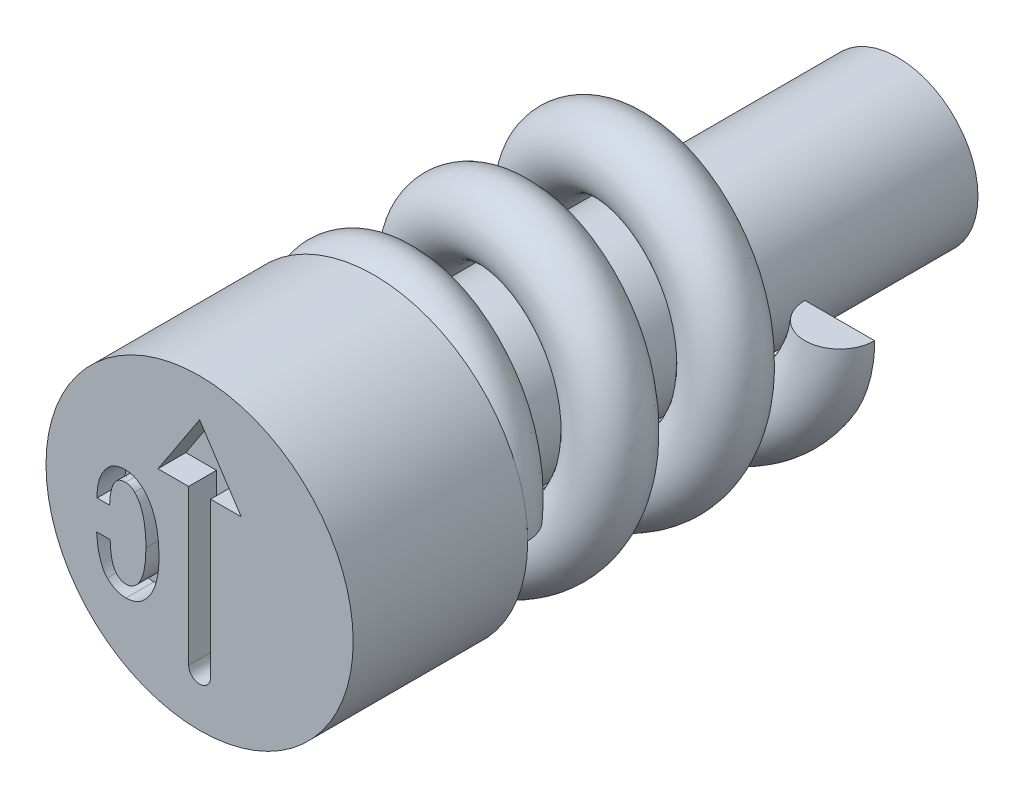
ISO-10303-21;
HEADER;
FILE_DESCRIPTION(('STEP AP214'),'2;1');
FILE_NAME('part.step','',(''),(''),'','','');
FILE_SCHEMA(('AUTOMOTIVE_DESIGN { 1 0 10303 214 1 1 1 1 }'));
ENDSEC;
DATA;
#1=APPLICATION_CONTEXT('core data for automotive mechanical design processes');
#2=APPLICATION_PROTOCOL_DEFINITION('international standard','automotive_design',2000,#1);
#3=PRODUCT_CONTEXT('',#1,'mechanical');
#4=PRODUCT('Part','Part','',(#3));
#5=PRODUCT_RELATED_PRODUCT_CATEGORY('part','',(#4));
#6=PRODUCT_DEFINITION_FORMATION('','',#4);
#7=PRODUCT_DEFINITION_CONTEXT('part definition',#1,'design');
#8=PRODUCT_DEFINITION('design','',#6,#7);
#9=PRODUCT_DEFINITION_SHAPE('','',#8);
#10=(LENGTH_UNIT() NAMED_UNIT(*) SI_UNIT(.MILLI.,.METRE.));
#11=(NAMED_UNIT(*) PLANE_ANGLE_UNIT() SI_UNIT($,.RADIAN.));
#12=(NAMED_UNIT(*) SI_UNIT($,.STERADIAN.) SOLID_ANGLE_UNIT());
#13=UNCERTAINTY_MEASURE_WITH_UNIT(LENGTH_MEASURE(1.E-05),#10,'distance_accuracy_value','');
#14=(GEOMETRIC_REPRESENTATION_CONTEXT(3) GLOBAL_UNCERTAINTY_ASSIGNED_CONTEXT((#13)) GLOBAL_UNIT_ASSIGNED_CONTEXT((#10,
#11,#12)) REPRESENTATION_CONTEXT('',''));
#15=CARTESIAN_POINT('',(0.,0.,0.));
#16=DIRECTION('',(0.,0.,1.));
#17=DIRECTION('',(1.,0.,0.));
#18=AXIS2_PLACEMENT_3D('',#15,#16,#17);
#19=CARTESIAN_POINT('',(1.7,0.,-7.97));
#20=DIRECTION('',(0.,-1.,0.));
#21=DIRECTION('',(0.,0.,-1.));
#22=AXIS2_PLACEMENT_3D('',#19,#20,#21);
#23=PLANE('',#22);
#24=CARTESIAN_POINT('',(1.7,0.,-7.47));
#25=DIRECTION('',(0.,1.,0.));
#26=DIRECTION('',(0.,0.,1.));
#27=AXIS2_PLACEMENT_3D('',#24,#25,#26);
#28=CIRCLE('',#27,0.5);
#29=CARTESIAN_POINT('',(1.2,0.,-7.47));
#30=VERTEX_POINT('',#29);
#31=CARTESIAN_POINT('',(2.2,0.,-7.47));
#32=VERTEX_POINT('',#31);
#33=EDGE_CURVE('E88',#30,#32,#28,.T.);
#34=ORIENTED_EDGE('',*,*,#33,.T.);
#35=DIRECTION('',(-1.,0.,0.));
#36=VECTOR('',#35,1.);
#37=CARTESIAN_POINT('',(1.7,0.,-7.47));
#38=LINE('',#37,#36);
#39=EDGE_CURVE('E75',#32,#30,#38,.T.);
#40=ORIENTED_EDGE('',*,*,#39,.T.);
#41=EDGE_LOOP('',(#34,#40));
#42=FACE_BOUND('',#41,.T.);
#43=ADVANCED_FACE('F49',(#42),#23,.F.);
#44=CARTESIAN_POINT('',(1.7,0.,-3.));
#45=DIRECTION('',(0.,-1.,0.));
#46=DIRECTION('',(0.,0.,-1.));
#47=AXIS2_PLACEMENT_3D('',#44,#45,#46);
#48=PLANE('',#47);
#49=DIRECTION('',(1.,0.,0.));
#50=VECTOR('',#49,1.);
#51=CARTESIAN_POINT('',(1.7,0.,-2.5));
#52=LINE('',#51,#50);
#53=CARTESIAN_POINT('',(1.2,0.,-2.5));
#54=VERTEX_POINT('',#53);
#55=CARTESIAN_POINT('',(2.2,0.,-2.5));
#56=VERTEX_POINT('',#55);
#57=EDGE_CURVE('E69',#54,#56,#52,.T.);
#58=ORIENTED_EDGE('',*,*,#57,.F.);
#59=CARTESIAN_POINT('',(1.7,0.,-2.5));
#60=DIRECTION('',(0.,-1.,0.));
#61=DIRECTION('',(0.,0.,-1.));
#62=AXIS2_PLACEMENT_3D('',#59,#60,#61);
#63=CIRCLE('',#62,0.5);
#64=EDGE_CURVE('E85',#54,#56,#63,.T.);
#65=ORIENTED_EDGE('',*,*,#64,.T.);
#66=EDGE_LOOP('',(#58,#65));
#67=FACE_BOUND('',#66,.T.);
#68=ADVANCED_FACE('F51',(#67),#48,.T.);
#69=CARTESIAN_POINT('',(1.7,0.,-6.97));
#70=CARTESIAN_POINT('',(1.7,-0.704163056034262,-6.86645833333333));
#71=CARTESIAN_POINT('',(1.20208152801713,-1.20208152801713,-6.76291666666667));
#72=CARTESIAN_POINT('',(0.704163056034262,-1.7,-6.659375));
#73=CARTESIAN_POINT('',(0.,-1.7,-6.55583333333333));
#74=CARTESIAN_POINT('',(-0.704163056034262,-1.7,-6.45229166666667));
#75=CARTESIAN_POINT('',(-1.20208152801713,-1.20208152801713,-6.34875));
#76=CARTESIAN_POINT('',(-1.7,-0.704163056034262,-6.24520833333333));
#77=CARTESIAN_POINT('',(-1.7,0.,-6.14166666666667));
#78=CARTESIAN_POINT('',(-1.7,0.704163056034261,-6.038125));
#79=CARTESIAN_POINT('',(-1.20208152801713,1.20208152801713,-5.93458333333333));
#80=CARTESIAN_POINT('',(-0.704163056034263,1.7,-5.83104166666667));
#81=CARTESIAN_POINT('',(0.,1.7,-5.7275));
#82=CARTESIAN_POINT('',(0.704163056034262,1.7,-5.62395833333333));
#83=CARTESIAN_POINT('',(1.20208152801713,1.20208152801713,-5.52041666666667));
#84=CARTESIAN_POINT('',(1.7,0.704163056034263,-5.416875));
#85=CARTESIAN_POINT('',(1.7,0.,-5.31333333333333));
#86=CARTESIAN_POINT('',(1.7,-0.704163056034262,-5.20979166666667));
#87=CARTESIAN_POINT('',(1.20208152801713,-1.20208152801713,-5.10625));
#88=CARTESIAN_POINT('',(0.704163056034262,-1.7,-5.00270833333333));
#89=CARTESIAN_POINT('',(0.,-1.7,-4.89916666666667));
#90=CARTESIAN_POINT('',(-0.704163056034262,-1.7,-4.795625));
#91=CARTESIAN_POINT('',(-1.20208152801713,-1.20208152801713,-4.69208333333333));
#92=CARTESIAN_POINT('',(-1.7,-0.704163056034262,-4.58854166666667));
#93=CARTESIAN_POINT('',(-1.7,0.,-4.485));
#94=CARTESIAN_POINT('',(-1.7,0.704163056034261,-4.38145833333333));
#95=CARTESIAN_POINT('',(-1.20208152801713,1.20208152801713,-4.27791666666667));
#96=CARTESIAN_POINT('',(-0.704163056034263,1.7,-4.174375));
#97=CARTESIAN_POINT('',(0.,1.7,-4.07083333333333));
#98=CARTESIAN_POINT('',(0.704163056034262,1.7,-3.96729166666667));
#99=CARTESIAN_POINT('',(1.20208152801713,1.20208152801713,-3.86375));
#100=CARTESIAN_POINT('',(1.7,0.704163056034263,-3.76020833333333));
#101=CARTESIAN_POINT('',(1.7,0.,-3.65666666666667));
#102=CARTESIAN_POINT('',(1.7,-0.704163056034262,-3.553125));
#103=CARTESIAN_POINT('',(1.20208152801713,-1.20208152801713,-3.44958333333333));
#104=CARTESIAN_POINT('',(0.704163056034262,-1.7,-3.34604166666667));
#105=CARTESIAN_POINT('',(0.,-1.7,-3.2425));
#106=CARTESIAN_POINT('',(-0.704163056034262,-1.7,-3.13895833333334));
#107=CARTESIAN_POINT('',(-1.20208152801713,-1.20208152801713,-3.03541666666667));
#108=CARTESIAN_POINT('',(-1.7,-0.704163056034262,-2.931875));
#109=CARTESIAN_POINT('',(-1.7,0.,-2.82833333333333));
#110=CARTESIAN_POINT('',(-1.7,0.704163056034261,-2.72479166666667));
#111=CARTESIAN_POINT('',(-1.20208152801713,1.20208152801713,-2.62125));
#112=CARTESIAN_POINT('',(-0.704163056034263,1.7,-2.51770833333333));
#113=CARTESIAN_POINT('',(0.,1.7,-2.41416666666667));
#114=CARTESIAN_POINT('',(0.704163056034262,1.7,-2.310625));
#115=CARTESIAN_POINT('',(1.20208152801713,1.20208152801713,-2.20708333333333));
#116=CARTESIAN_POINT('',(1.7,0.704163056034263,-2.10354166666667));
#117=CARTESIAN_POINT('',(1.7,0.,-2.));
#118=CARTESIAN_POINT('',(2.7,0.,-6.97));
#119=CARTESIAN_POINT('',(2.7,-1.11837661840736,-6.86645833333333));
#120=CARTESIAN_POINT('',(1.90918830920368,-1.90918830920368,-6.76291666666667));
#121=CARTESIAN_POINT('',(1.11837661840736,-2.7,-6.659375));
#122=CARTESIAN_POINT('',(0.,-2.7,-6.55583333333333));
#123=CARTESIAN_POINT('',(-1.11837661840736,-2.7,-6.45229166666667));
#124=CARTESIAN_POINT('',(-1.90918830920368,-1.90918830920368,-6.34875));
#125=CARTESIAN_POINT('',(-2.7,-1.11837661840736,-6.24520833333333));
#126=CARTESIAN_POINT('',(-2.7,0.,-6.14166666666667));
#127=CARTESIAN_POINT('',(-2.7,1.11837661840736,-6.038125));
#128=CARTESIAN_POINT('',(-1.90918830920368,1.90918830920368,-5.93458333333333));
#129=CARTESIAN_POINT('',(-1.11837661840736,2.7,-5.83104166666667));
#130=CARTESIAN_POINT('',(0.,2.7,-5.7275));
#131=CARTESIAN_POINT('',(1.11837661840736,2.7,-5.62395833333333));
#132=CARTESIAN_POINT('',(1.90918830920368,1.90918830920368,-5.52041666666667));
#133=CARTESIAN_POINT('',(2.7,1.11837661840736,-5.416875));
#134=CARTESIAN_POINT('',(2.7,0.,-5.31333333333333));
#135=CARTESIAN_POINT('',(2.7,-1.11837661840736,-5.20979166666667));
#136=CARTESIAN_POINT('',(1.90918830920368,-1.90918830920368,-5.10625));
#137=CARTESIAN_POINT('',(1.11837661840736,-2.7,-5.00270833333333));
#138=CARTESIAN_POINT('',(0.,-2.7,-4.89916666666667));
#139=CARTESIAN_POINT('',(-1.11837661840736,-2.7,-4.795625));
#140=CARTESIAN_POINT('',(-1.90918830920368,-1.90918830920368,-4.69208333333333));
#141=CARTESIAN_POINT('',(-2.7,-1.11837661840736,-4.58854166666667));
#142=CARTESIAN_POINT('',(-2.7,0.,-4.485));
#143=CARTESIAN_POINT('',(-2.7,1.11837661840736,-4.38145833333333));
#144=CARTESIAN_POINT('',(-1.90918830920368,1.90918830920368,-4.27791666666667));
#145=CARTESIAN_POINT('',(-1.11837661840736,2.7,-4.174375));
#146=CARTESIAN_POINT('',(0.,2.7,-4.07083333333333));
#147=CARTESIAN_POINT('',(1.11837661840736,2.7,-3.96729166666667));
#148=CARTESIAN_POINT('',(1.90918830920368,1.90918830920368,-3.86375));
#149=CARTESIAN_POINT('',(2.7,1.11837661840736,-3.76020833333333));
#150=CARTESIAN_POINT('',(2.7,0.,-3.65666666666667));
#151=CARTESIAN_POINT('',(2.7,-1.11837661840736,-3.553125));
#152=CARTESIAN_POINT('',(1.90918830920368,-1.90918830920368,-3.44958333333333));
#153=CARTESIAN_POINT('',(1.11837661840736,-2.7,-3.34604166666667));
#154=CARTESIAN_POINT('',(0.,-2.7,-3.2425));
#155=CARTESIAN_POINT('',(-1.11837661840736,-2.7,-3.13895833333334));
#156=CARTESIAN_POINT('',(-1.90918830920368,-1.90918830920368,-3.03541666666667));
#157=CARTESIAN_POINT('',(-2.7,-1.11837661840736,-2.931875));
#158=CARTESIAN_POINT('',(-2.7,0.,-2.82833333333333));
#159=CARTESIAN_POINT('',(-2.7,1.11837661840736,-2.72479166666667));
#160=CARTESIAN_POINT('',(-1.90918830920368,1.90918830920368,-2.62125));
#161=CARTESIAN_POINT('',(-1.11837661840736,2.7,-2.51770833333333));
#162=CARTESIAN_POINT('',(0.,2.7,-2.41416666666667));
#163=CARTESIAN_POINT('',(1.11837661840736,2.7,-2.310625));
#164=CARTESIAN_POINT('',(1.90918830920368,1.90918830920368,-2.20708333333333));
#165=CARTESIAN_POINT('',(2.7,1.11837661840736,-2.10354166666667));
#166=CARTESIAN_POINT('',(2.7,0.,-2.));
#167=CARTESIAN_POINT('',(2.7,0.,-7.97));
#168=CARTESIAN_POINT('',(2.7,-1.11837661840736,-7.86645833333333));
#169=CARTESIAN_POINT('',(1.90918830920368,-1.90918830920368,-7.76291666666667));
#170=CARTESIAN_POINT('',(1.11837661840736,-2.7,-7.659375));
#171=CARTESIAN_POINT('',(0.,-2.7,-7.55583333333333));
#172=CARTESIAN_POINT('',(-1.11837661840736,-2.7,-7.45229166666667));
#173=CARTESIAN_POINT('',(-1.90918830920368,-1.90918830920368,-7.34875));
#174=CARTESIAN_POINT('',(-2.7,-1.11837661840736,-7.24520833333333));
#175=CARTESIAN_POINT('',(-2.7,0.,-7.14166666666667));
#176=CARTESIAN_POINT('',(-2.7,1.11837661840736,-7.038125));
#177=CARTESIAN_POINT('',(-1.90918830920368,1.90918830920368,-6.93458333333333));
#178=CARTESIAN_POINT('',(-1.11837661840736,2.7,-6.83104166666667));
#179=CARTESIAN_POINT('',(0.,2.7,-6.7275));
#180=CARTESIAN_POINT('',(1.11837661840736,2.7,-6.62395833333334));
#181=CARTESIAN_POINT('',(1.90918830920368,1.90918830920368,-6.52041666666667));
#182=CARTESIAN_POINT('',(2.7,1.11837661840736,-6.416875));
#183=CARTESIAN_POINT('',(2.7,0.,-6.31333333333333));
#184=CARTESIAN_POINT('',(2.7,-1.11837661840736,-6.20979166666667));
#185=CARTESIAN_POINT('',(1.90918830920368,-1.90918830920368,-6.10625));
#186=CARTESIAN_POINT('',(1.11837661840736,-2.7,-6.00270833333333));
#187=CARTESIAN_POINT('',(0.,-2.7,-5.89916666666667));
#188=CARTESIAN_POINT('',(-1.11837661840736,-2.7,-5.795625));
#189=CARTESIAN_POINT('',(-1.90918830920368,-1.90918830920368,-5.69208333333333));
#190=CARTESIAN_POINT('',(-2.7,-1.11837661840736,-5.58854166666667));
#191=CARTESIAN_POINT('',(-2.7,0.,-5.485));
#192=CARTESIAN_POINT('',(-2.7,1.11837661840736,-5.38145833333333));
#193=CARTESIAN_POINT('',(-1.90918830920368,1.90918830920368,-5.27791666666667));
#194=CARTESIAN_POINT('',(-1.11837661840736,2.7,-5.174375));
#195=CARTESIAN_POINT('',(0.,2.7,-5.07083333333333));
#196=CARTESIAN_POINT('',(1.11837661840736,2.7,-4.96729166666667));
#197=CARTESIAN_POINT('',(1.90918830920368,1.90918830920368,-4.86375));
#198=CARTESIAN_POINT('',(2.7,1.11837661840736,-4.76020833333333));
#199=CARTESIAN_POINT('',(2.7,0.,-4.65666666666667));
#200=CARTESIAN_POINT('',(2.7,-1.11837661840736,-4.553125));
#201=CARTESIAN_POINT('',(1.90918830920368,-1.90918830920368,-4.44958333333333));
#202=CARTESIAN_POINT('',(1.11837661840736,-2.7,-4.34604166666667));
#203=CARTESIAN_POINT('',(0.,-2.7,-4.2425));
#204=CARTESIAN_POINT('',(-1.11837661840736,-2.7,-4.13895833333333));
#205=CARTESIAN_POINT('',(-1.90918830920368,-1.90918830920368,-4.03541666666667));
#206=CARTESIAN_POINT('',(-2.7,-1.11837661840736,-3.931875));
#207=CARTESIAN_POINT('',(-2.7,0.,-3.82833333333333));
#208=CARTESIAN_POINT('',(-2.7,1.11837661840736,-3.72479166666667));
#209=CARTESIAN_POINT('',(-1.90918830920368,1.90918830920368,-3.62125));
#210=CARTESIAN_POINT('',(-1.11837661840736,2.7,-3.51770833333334));
#211=CARTESIAN_POINT('',(0.,2.7,-3.41416666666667));
#212=CARTESIAN_POINT('',(1.11837661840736,2.7,-3.310625));
#213=CARTESIAN_POINT('',(1.90918830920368,1.90918830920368,-3.20708333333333));
#214=CARTESIAN_POINT('',(2.7,1.11837661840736,-3.10354166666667));
#215=CARTESIAN_POINT('',(2.7,0.,-3.));
#216=CARTESIAN_POINT('',(1.7,0.,-7.97));
#217=CARTESIAN_POINT('',(1.7,-0.704163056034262,-7.86645833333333));
#218=CARTESIAN_POINT('',(1.20208152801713,-1.20208152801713,-7.76291666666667));
#219=CARTESIAN_POINT('',(0.704163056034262,-1.7,-7.659375));
#220=CARTESIAN_POINT('',(0.,-1.7,-7.55583333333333));
#221=CARTESIAN_POINT('',(-0.704163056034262,-1.7,-7.45229166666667));
#222=CARTESIAN_POINT('',(-1.20208152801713,-1.20208152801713,-7.34875));
#223=CARTESIAN_POINT('',(-1.7,-0.704163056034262,-7.24520833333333));
#224=CARTESIAN_POINT('',(-1.7,0.,-7.14166666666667));
#225=CARTESIAN_POINT('',(-1.7,0.704163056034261,-7.038125));
#226=CARTESIAN_POINT('',(-1.20208152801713,1.20208152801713,-6.93458333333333));
#227=CARTESIAN_POINT('',(-0.704163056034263,1.7,-6.83104166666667));
#228=CARTESIAN_POINT('',(0.,1.7,-6.7275));
#229=CARTESIAN_POINT('',(0.704163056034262,1.7,-6.62395833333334));
#230=CARTESIAN_POINT('',(1.20208152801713,1.20208152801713,-6.52041666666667));
#231=CARTESIAN_POINT('',(1.7,0.704163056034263,-6.416875));
#232=CARTESIAN_POINT('',(1.7,0.,-6.31333333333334));
#233=CARTESIAN_POINT('',(1.7,-0.704163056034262,-6.20979166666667));
#234=CARTESIAN_POINT('',(1.20208152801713,-1.20208152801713,-6.10625));
#235=CARTESIAN_POINT('',(0.704163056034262,-1.7,-6.00270833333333));
#236=CARTESIAN_POINT('',(0.,-1.7,-5.89916666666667));
#237=CARTESIAN_POINT('',(-0.704163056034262,-1.7,-5.795625));
#238=CARTESIAN_POINT('',(-1.20208152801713,-1.20208152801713,-5.69208333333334));
#239=CARTESIAN_POINT('',(-1.7,-0.704163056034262,-5.58854166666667));
#240=CARTESIAN_POINT('',(-1.7,0.,-5.485));
#241=CARTESIAN_POINT('',(-1.7,0.704163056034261,-5.38145833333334));
#242=CARTESIAN_POINT('',(-1.20208152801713,1.20208152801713,-5.27791666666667));
#243=CARTESIAN_POINT('',(-0.704163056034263,1.7,-5.174375));
#244=CARTESIAN_POINT('',(0.,1.7,-5.07083333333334));
#245=CARTESIAN_POINT('',(0.704163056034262,1.7,-4.96729166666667));
#246=CARTESIAN_POINT('',(1.20208152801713,1.20208152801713,-4.86375));
#247=CARTESIAN_POINT('',(1.7,0.704163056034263,-4.76020833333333));
#248=CARTESIAN_POINT('',(1.7,0.,-4.65666666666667));
#249=CARTESIAN_POINT('',(1.7,-0.704163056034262,-4.553125));
#250=CARTESIAN_POINT('',(1.20208152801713,-1.20208152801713,-4.44958333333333));
#251=CARTESIAN_POINT('',(0.704163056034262,-1.7,-4.34604166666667));
#252=CARTESIAN_POINT('',(0.,-1.7,-4.2425));
#253=CARTESIAN_POINT('',(-0.704163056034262,-1.7,-4.13895833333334));
#254=CARTESIAN_POINT('',(-1.20208152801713,-1.20208152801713,-4.03541666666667));
#255=CARTESIAN_POINT('',(-1.7,-0.704163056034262,-3.931875));
#256=CARTESIAN_POINT('',(-1.7,0.,-3.82833333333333));
#257=CARTESIAN_POINT('',(-1.7,0.704163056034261,-3.72479166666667));
#258=CARTESIAN_POINT('',(-1.20208152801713,1.20208152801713,-3.62125));
#259=CARTESIAN_POINT('',(-0.704163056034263,1.7,-3.51770833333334));
#260=CARTESIAN_POINT('',(0.,1.7,-3.41416666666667));
#261=CARTESIAN_POINT('',(0.704163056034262,1.7,-3.310625));
#262=CARTESIAN_POINT('',(1.20208152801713,1.20208152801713,-3.20708333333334));
#263=CARTESIAN_POINT('',(1.7,0.704163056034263,-3.10354166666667));
#264=CARTESIAN_POINT('',(1.7,0.,-3.));
#265=CARTESIAN_POINT('',(0.7,0.,-7.97));
#266=CARTESIAN_POINT('',(0.7,-0.289949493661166,-7.86645833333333));
#267=CARTESIAN_POINT('',(0.494974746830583,-0.494974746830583,-7.76291666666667));
#268=CARTESIAN_POINT('',(0.289949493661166,-0.7,-7.659375));
#269=CARTESIAN_POINT('',(0.,-0.7,-7.55583333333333));
#270=CARTESIAN_POINT('',(-0.289949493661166,-0.7,-7.45229166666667));
#271=CARTESIAN_POINT('',(-0.494974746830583,-0.494974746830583,-7.34875));
#272=CARTESIAN_POINT('',(-0.7,-0.289949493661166,-7.24520833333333));
#273=CARTESIAN_POINT('',(-0.7,0.,-7.14166666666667));
#274=CARTESIAN_POINT('',(-0.7,0.289949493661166,-7.038125));
#275=CARTESIAN_POINT('',(-0.494974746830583,0.494974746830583,-6.93458333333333));
#276=CARTESIAN_POINT('',(-0.289949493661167,0.7,-6.83104166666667));
#277=CARTESIAN_POINT('',(0.,0.7,-6.7275));
#278=CARTESIAN_POINT('',(0.289949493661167,0.7,-6.62395833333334));
#279=CARTESIAN_POINT('',(0.494974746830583,0.494974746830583,-6.52041666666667));
#280=CARTESIAN_POINT('',(0.7,0.289949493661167,-6.416875));
#281=CARTESIAN_POINT('',(0.7,0.,-6.31333333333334));
#282=CARTESIAN_POINT('',(0.7,-0.289949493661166,-6.20979166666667));
#283=CARTESIAN_POINT('',(0.494974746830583,-0.494974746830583,-6.10625));
#284=CARTESIAN_POINT('',(0.289949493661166,-0.7,-6.00270833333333));
#285=CARTESIAN_POINT('',(0.,-0.7,-5.89916666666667));
#286=CARTESIAN_POINT('',(-0.289949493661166,-0.7,-5.795625));
#287=CARTESIAN_POINT('',(-0.494974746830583,-0.494974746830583,-5.69208333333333));
#288=CARTESIAN_POINT('',(-0.7,-0.289949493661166,-5.58854166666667));
#289=CARTESIAN_POINT('',(-0.7,0.,-5.485));
#290=CARTESIAN_POINT('',(-0.7,0.289949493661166,-5.38145833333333));
#291=CARTESIAN_POINT('',(-0.494974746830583,0.494974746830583,-5.27791666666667));
#292=CARTESIAN_POINT('',(-0.289949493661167,0.7,-5.174375));
#293=CARTESIAN_POINT('',(0.,0.7,-5.07083333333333));
#294=CARTESIAN_POINT('',(0.289949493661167,0.7,-4.96729166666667));
#295=CARTESIAN_POINT('',(0.494974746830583,0.494974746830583,-4.86375));
#296=CARTESIAN_POINT('',(0.7,0.289949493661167,-4.76020833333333));
#297=CARTESIAN_POINT('',(0.7,0.,-4.65666666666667));
#298=CARTESIAN_POINT('',(0.7,-0.289949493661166,-4.553125));
#299=CARTESIAN_POINT('',(0.494974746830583,-0.494974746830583,-4.44958333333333));
#300=CARTESIAN_POINT('',(0.289949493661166,-0.7,-4.34604166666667));
#301=CARTESIAN_POINT('',(0.,-0.7,-4.2425));
#302=CARTESIAN_POINT('',(-0.289949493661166,-0.7,-4.13895833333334));
#303=CARTESIAN_POINT('',(-0.494974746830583,-0.494974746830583,-4.03541666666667));
#304=CARTESIAN_POINT('',(-0.7,-0.289949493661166,-3.931875));
#305=CARTESIAN_POINT('',(-0.7,0.,-3.82833333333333));
#306=CARTESIAN_POINT('',(-0.7,0.289949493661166,-3.72479166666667));
#307=CARTESIAN_POINT('',(-0.494974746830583,0.494974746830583,-3.62125));
#308=CARTESIAN_POINT('',(-0.289949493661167,0.7,-3.51770833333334));
#309=CARTESIAN_POINT('',(0.,0.7,-3.41416666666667));
#310=CARTESIAN_POINT('',(0.289949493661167,0.7,-3.310625));
#311=CARTESIAN_POINT('',(0.494974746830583,0.494974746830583,-3.20708333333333));
#312=CARTESIAN_POINT('',(0.7,0.289949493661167,-3.10354166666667));
#313=CARTESIAN_POINT('',(0.7,0.,-3.));
#314=CARTESIAN_POINT('',(0.7,0.,-6.97));
#315=CARTESIAN_POINT('',(0.7,-0.289949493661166,-6.86645833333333));
#316=CARTESIAN_POINT('',(0.494974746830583,-0.494974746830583,-6.76291666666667));
#317=CARTESIAN_POINT('',(0.289949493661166,-0.7,-6.659375));
#318=CARTESIAN_POINT('',(0.,-0.7,-6.55583333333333));
#319=CARTESIAN_POINT('',(-0.289949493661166,-0.7,-6.45229166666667));
#320=CARTESIAN_POINT('',(-0.494974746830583,-0.494974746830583,-6.34875));
#321=CARTESIAN_POINT('',(-0.7,-0.289949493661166,-6.24520833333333));
#322=CARTESIAN_POINT('',(-0.7,0.,-6.14166666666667));
#323=CARTESIAN_POINT('',(-0.7,0.289949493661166,-6.038125));
#324=CARTESIAN_POINT('',(-0.494974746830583,0.494974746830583,-5.93458333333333));
#325=CARTESIAN_POINT('',(-0.289949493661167,0.7,-5.83104166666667));
#326=CARTESIAN_POINT('',(0.,0.7,-5.7275));
#327=CARTESIAN_POINT('',(0.289949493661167,0.7,-5.62395833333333));
#328=CARTESIAN_POINT('',(0.494974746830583,0.494974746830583,-5.52041666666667));
#329=CARTESIAN_POINT('',(0.7,0.289949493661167,-5.416875));
#330=CARTESIAN_POINT('',(0.7,0.,-5.31333333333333));
#331=CARTESIAN_POINT('',(0.7,-0.289949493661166,-5.20979166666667));
#332=CARTESIAN_POINT('',(0.494974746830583,-0.494974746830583,-5.10625));
#333=CARTESIAN_POINT('',(0.289949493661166,-0.7,-5.00270833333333));
#334=CARTESIAN_POINT('',(0.,-0.7,-4.89916666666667));
#335=CARTESIAN_POINT('',(-0.289949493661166,-0.7,-4.795625));
#336=CARTESIAN_POINT('',(-0.494974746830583,-0.494974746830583,-4.69208333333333));
#337=CARTESIAN_POINT('',(-0.7,-0.289949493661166,-4.58854166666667));
#338=CARTESIAN_POINT('',(-0.7,0.,-4.485));
#339=CARTESIAN_POINT('',(-0.7,0.289949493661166,-4.38145833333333));
#340=CARTESIAN_POINT('',(-0.494974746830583,0.494974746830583,-4.27791666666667));
#341=CARTESIAN_POINT('',(-0.289949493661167,0.7,-4.174375));
#342=CARTESIAN_POINT('',(0.,0.7,-4.07083333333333));
#343=CARTESIAN_POINT('',(0.289949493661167,0.7,-3.96729166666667));
#344=CARTESIAN_POINT('',(0.494974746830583,0.494974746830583,-3.86375));
#345=CARTESIAN_POINT('',(0.7,0.289949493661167,-3.76020833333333));
#346=CARTESIAN_POINT('',(0.7,0.,-3.65666666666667));
#347=CARTESIAN_POINT('',(0.7,-0.289949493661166,-3.553125));
#348=CARTESIAN_POINT('',(0.494974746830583,-0.494974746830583,-3.44958333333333));
#349=CARTESIAN_POINT('',(0.289949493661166,-0.7,-3.34604166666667));
#350=CARTESIAN_POINT('',(0.,-0.7,-3.2425));
#351=CARTESIAN_POINT('',(-0.289949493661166,-0.7,-3.13895833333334));
#352=CARTESIAN_POINT('',(-0.494974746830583,-0.494974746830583,-3.03541666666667));
#353=CARTESIAN_POINT('',(-0.7,-0.289949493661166,-2.931875));
#354=CARTESIAN_POINT('',(-0.7,0.,-2.82833333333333));
#355=CARTESIAN_POINT('',(-0.7,0.289949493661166,-2.72479166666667));
#356=CARTESIAN_POINT('',(-0.494974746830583,0.494974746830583,-2.62125));
#357=CARTESIAN_POINT('',(-0.289949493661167,0.7,-2.51770833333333));
#358=CARTESIAN_POINT('',(0.,0.7,-2.41416666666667));
#359=CARTESIAN_POINT('',(0.289949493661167,0.7,-2.310625));
#360=CARTESIAN_POINT('',(0.494974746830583,0.494974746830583,-2.20708333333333));
#361=CARTESIAN_POINT('',(0.7,0.289949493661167,-2.10354166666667));
#362=CARTESIAN_POINT('',(0.7,0.,-2.));
#363=CARTESIAN_POINT('',(1.7,0.,-6.97));
#364=CARTESIAN_POINT('',(1.7,-0.704163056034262,-6.86645833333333));
#365=CARTESIAN_POINT('',(1.20208152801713,-1.20208152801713,-6.76291666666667));
#366=CARTESIAN_POINT('',(0.704163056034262,-1.7,-6.659375));
#367=CARTESIAN_POINT('',(0.,-1.7,-6.55583333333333));
#368=CARTESIAN_POINT('',(-0.704163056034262,-1.7,-6.45229166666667));
#369=CARTESIAN_POINT('',(-1.20208152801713,-1.20208152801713,-6.34875));
#370=CARTESIAN_POINT('',(-1.7,-0.704163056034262,-6.24520833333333));
#371=CARTESIAN_POINT('',(-1.7,0.,-6.14166666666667));
#372=CARTESIAN_POINT('',(-1.7,0.704163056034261,-6.038125));
#373=CARTESIAN_POINT('',(-1.20208152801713,1.20208152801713,-5.93458333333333));
#374=CARTESIAN_POINT('',(-0.704163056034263,1.7,-5.83104166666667));
#375=CARTESIAN_POINT('',(0.,1.7,-5.7275));
#376=CARTESIAN_POINT('',(0.704163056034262,1.7,-5.62395833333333));
#377=CARTESIAN_POINT('',(1.20208152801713,1.20208152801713,-5.52041666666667));
#378=CARTESIAN_POINT('',(1.7,0.704163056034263,-5.416875));
#379=CARTESIAN_POINT('',(1.7,0.,-5.31333333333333));
#380=CARTESIAN_POINT('',(1.7,-0.704163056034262,-5.20979166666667));
#381=CARTESIAN_POINT('',(1.20208152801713,-1.20208152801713,-5.10625));
#382=CARTESIAN_POINT('',(0.704163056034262,-1.7,-5.00270833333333));
#383=CARTESIAN_POINT('',(0.,-1.7,-4.89916666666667));
#384=CARTESIAN_POINT('',(-0.704163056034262,-1.7,-4.795625));
#385=CARTESIAN_POINT('',(-1.20208152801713,-1.20208152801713,-4.69208333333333));
#386=CARTESIAN_POINT('',(-1.7,-0.704163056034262,-4.58854166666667));
#387=CARTESIAN_POINT('',(-1.7,0.,-4.485));
#388=CARTESIAN_POINT('',(-1.7,0.704163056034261,-4.38145833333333));
#389=CARTESIAN_POINT('',(-1.20208152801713,1.20208152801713,-4.27791666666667));
#390=CARTESIAN_POINT('',(-0.704163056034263,1.7,-4.174375));
#391=CARTESIAN_POINT('',(0.,1.7,-4.07083333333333));
#392=CARTESIAN_POINT('',(0.704163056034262,1.7,-3.96729166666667));
#393=CARTESIAN_POINT('',(1.20208152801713,1.20208152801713,-3.86375));
#394=CARTESIAN_POINT('',(1.7,0.704163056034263,-3.76020833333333));
#395=CARTESIAN_POINT('',(1.7,0.,-3.65666666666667));
#396=CARTESIAN_POINT('',(1.7,-0.704163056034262,-3.553125));
#397=CARTESIAN_POINT('',(1.20208152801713,-1.20208152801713,-3.44958333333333));
#398=CARTESIAN_POINT('',(0.704163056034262,-1.7,-3.34604166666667));
#399=CARTESIAN_POINT('',(0.,-1.7,-3.2425));
#400=CARTESIAN_POINT('',(-0.704163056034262,-1.7,-3.13895833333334));
#401=CARTESIAN_POINT('',(-1.20208152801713,-1.20208152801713,-3.03541666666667));
#402=CARTESIAN_POINT('',(-1.7,-0.704163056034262,-2.931875));
#403=CARTESIAN_POINT('',(-1.7,0.,-2.82833333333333));
#404=CARTESIAN_POINT('',(-1.7,0.704163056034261,-2.72479166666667));
#405=CARTESIAN_POINT('',(-1.20208152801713,1.20208152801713,-2.62125));
#406=CARTESIAN_POINT('',(-0.704163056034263,1.7,-2.51770833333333));
#407=CARTESIAN_POINT('',(0.,1.7,-2.41416666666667));
#408=CARTESIAN_POINT('',(0.704163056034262,1.7,-2.310625));
#409=CARTESIAN_POINT('',(1.20208152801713,1.20208152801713,-2.20708333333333));
#410=CARTESIAN_POINT('',(1.7,0.704163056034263,-2.10354166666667));
#411=CARTESIAN_POINT('',(1.7,0.,-2.));
#412=(BOUNDED_SURFACE() B_SPLINE_SURFACE(3,2,((#69,#70,#71,#72,#73,#74,#75,#76,#77,#78,#79,#80,
#81,#82,#83,#84,#85,#86,#87,#88,#89,#90,#91,#92,#93,#94,#95,#96,#97,#98,#99,#100,#101,#102,#103,
#104,#105,#106,#107,#108,#109,#110,#111,#112,#113,#114,#115,#116,#117),(#118,#119,#120,#121,
#122,#123,#124,#125,#126,#127,#128,#129,#130,#131,#132,#133,#134,#135,#136,#137,#138,#139,#140,
#141,#142,#143,#144,#145,#146,#147,#148,#149,#150,#151,#152,#153,#154,#155,#156,#157,#158,#159,
#160,#161,#162,#163,#164,#165,#166),(#167,#168,#169,#170,#171,#172,#173,#174,#175,#176,#177,
#178,#179,#180,#181,#182,#183,#184,#185,#186,#187,#188,#189,#190,#191,#192,#193,#194,#195,#196,
#197,#198,#199,#200,#201,#202,#203,#204,#205,#206,#207,#208,#209,#210,#211,#212,#213,#214,#215),
(#216,#217,#218,#219,#220,#221,#222,#223,#224,#225,#226,#227,#228,#229,#230,#231,#232,#233,#234,
#235,#236,#237,#238,#239,#240,#241,#242,#243,#244,#245,#246,#247,#248,#249,#250,#251,#252,#253,
#254,#255,#256,#257,#258,#259,#260,#261,#262,#263,#264),(#265,#266,#267,#268,#269,#270,#271,
#272,#273,#274,#275,#276,#277,#278,#279,#280,#281,#282,#283,#284,#285,#286,#287,#288,#289,#290,
#291,#292,#293,#294,#295,#296,#297,#298,#299,#300,#301,#302,#303,#304,#305,#306,#307,#308,#309,
#310,#311,#312,#313),(#314,#315,#316,#317,#318,#319,#320,#321,#322,#323,#324,#325,#326,#327,
#328,#329,#330,#331,#332,#333,#334,#335,#336,#337,#338,#339,#340,#341,#342,#343,#344,#345,#346,
#347,#348,#349,#350,#351,#352,#353,#354,#355,#356,#357,#358,#359,#360,#361,#362),(#363,#364,
#365,#366,#367,#368,#369,#370,#371,#372,#373,#374,#375,#376,#377,#378,#379,#380,#381,#382,#383,
#384,#385,#386,#387,#388,#389,#390,#391,#392,#393,#394,#395,#396,#397,#398,#399,#400,#401,#402,
#403,#404,#405,#406,#407,#408,#409,#410,#411)),.UNSPECIFIED.,.T.,.F.,
.F.) B_SPLINE_SURFACE_WITH_KNOTS((4,3,4),(3,2,2,2,2,2,2,2,2,2,2,2,2,2,2,2,2,2,2,2,2,2,2,2,3),
(0.,0.5,1.),(0.,0.0416666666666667,0.0833333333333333,0.125,0.166666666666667,0.208333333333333,
0.25,0.291666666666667,0.333333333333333,0.375,0.416666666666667,0.458333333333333,0.5,
0.541666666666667,0.583333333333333,0.625,0.666666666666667,0.708333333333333,0.75,
0.791666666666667,0.833333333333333,0.875,0.916666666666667,0.958333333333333,1.),
.UNSPECIFIED.) GEOMETRIC_REPRESENTATION_ITEM() RATIONAL_B_SPLINE_SURFACE(((1.,0.923879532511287,
1.,0.923879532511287,1.,0.923879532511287,1.,0.923879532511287,1.,0.923879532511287,1.,
0.923879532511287,1.,0.923879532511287,1.,0.923879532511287,1.,0.923879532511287,1.,
0.923879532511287,1.,0.923879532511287,1.,0.923879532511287,1.,0.923879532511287,1.,
0.923879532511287,1.,0.923879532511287,1.,0.923879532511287,1.,0.923879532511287,1.,
0.923879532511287,1.,0.923879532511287,1.,0.923879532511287,1.,0.923879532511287,1.,
0.923879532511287,1.,0.923879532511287,1.,0.923879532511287,1.),(0.333333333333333,
0.307959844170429,0.333333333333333,0.307959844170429,0.333333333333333,0.307959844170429,
0.333333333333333,0.307959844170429,0.333333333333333,0.307959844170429,0.333333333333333,
0.307959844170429,0.333333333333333,0.307959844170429,0.333333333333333,0.307959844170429,
0.333333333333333,0.307959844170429,0.333333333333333,0.307959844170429,0.333333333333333,
0.307959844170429,0.333333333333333,0.307959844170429,0.333333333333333,0.307959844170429,
0.333333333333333,0.307959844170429,0.333333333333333,0.307959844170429,0.333333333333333,
0.307959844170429,0.333333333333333,0.307959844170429,0.333333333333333,0.307959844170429,
0.333333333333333,0.307959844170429,0.333333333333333,0.307959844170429,0.333333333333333,
0.307959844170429,0.333333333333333,0.307959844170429,0.333333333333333,0.307959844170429,
0.333333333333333,0.307959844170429,0.333333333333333),(0.333333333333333,0.307959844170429,
0.333333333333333,0.307959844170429,0.333333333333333,0.307959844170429,0.333333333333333,
0.307959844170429,0.333333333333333,0.307959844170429,0.333333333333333,0.307959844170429,
0.333333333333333,0.307959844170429,0.333333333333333,0.307959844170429,0.333333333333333,
0.307959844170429,0.333333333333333,0.307959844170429,0.333333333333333,0.307959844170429,
0.333333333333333,0.307959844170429,0.333333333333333,0.307959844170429,0.333333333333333,
0.307959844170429,0.333333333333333,0.307959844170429,0.333333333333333,0.307959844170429,
0.333333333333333,0.307959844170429,0.333333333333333,0.307959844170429,0.333333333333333,
0.307959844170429,0.333333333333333,0.307959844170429,0.333333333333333,0.307959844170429,
0.333333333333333,0.307959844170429,0.333333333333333,0.307959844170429,0.333333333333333,
0.307959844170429,0.333333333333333),(1.,0.923879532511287,1.,0.923879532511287,1.,
0.923879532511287,1.,0.923879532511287,1.,0.923879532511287,1.,0.923879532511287,1.,
0.923879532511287,1.,0.923879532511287,1.,0.923879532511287,1.,0.923879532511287,1.,
0.923879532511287,1.,0.923879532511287,1.,0.923879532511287,1.,0.923879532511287,1.,
0.923879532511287,1.,0.923879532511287,1.,0.923879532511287,1.,0.923879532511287,1.,
0.923879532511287,1.,0.923879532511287,1.,0.923879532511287,1.,0.923879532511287,1.,
0.923879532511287,1.,0.923879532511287,1.),(0.333333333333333,0.307959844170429,
0.333333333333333,0.307959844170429,0.333333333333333,0.307959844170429,0.333333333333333,
0.307959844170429,0.333333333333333,0.307959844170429,0.333333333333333,0.307959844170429,
0.333333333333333,0.307959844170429,0.333333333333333,0.307959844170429,0.333333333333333,
0.307959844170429,0.333333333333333,0.307959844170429,0.333333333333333,0.307959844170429,
0.333333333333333,0.307959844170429,0.333333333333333,0.307959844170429,0.333333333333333,
0.307959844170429,0.333333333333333,0.307959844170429,0.333333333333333,0.307959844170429,
0.333333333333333,0.307959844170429,0.333333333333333,0.307959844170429,0.333333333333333,
0.307959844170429,0.333333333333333,0.307959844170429,0.333333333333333,0.307959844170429,
0.333333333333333,0.307959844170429,0.333333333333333,0.307959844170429,0.333333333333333,
0.307959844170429,0.333333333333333),(0.333333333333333,0.307959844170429,0.333333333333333,
0.307959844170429,0.333333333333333,0.307959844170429,0.333333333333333,0.307959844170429,
0.333333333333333,0.307959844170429,0.333333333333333,0.307959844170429,0.333333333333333,
0.307959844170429,0.333333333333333,0.307959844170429,0.333333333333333,0.307959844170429,
0.333333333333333,0.307959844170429,0.333333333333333,0.307959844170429,0.333333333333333,
0.307959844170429,0.333333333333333,0.307959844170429,0.333333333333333,0.307959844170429,
0.333333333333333,0.307959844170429,0.333333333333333,0.307959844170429,0.333333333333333,
0.307959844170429,0.333333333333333,0.307959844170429,0.333333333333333,0.307959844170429,
0.333333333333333,0.307959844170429,0.333333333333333,0.307959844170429,0.333333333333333,
0.307959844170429,0.333333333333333,0.307959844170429,0.333333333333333,0.307959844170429,
0.333333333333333),(1.,0.923879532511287,1.,0.923879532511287,1.,0.923879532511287,1.,
0.923879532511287,1.,0.923879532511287,1.,0.923879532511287,1.,0.923879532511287,1.,
0.923879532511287,1.,0.923879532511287,1.,0.923879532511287,1.,0.923879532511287,1.,
0.923879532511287,1.,0.923879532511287,1.,0.923879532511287,1.,0.923879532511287,1.,
0.923879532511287,1.,0.923879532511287,1.,0.923879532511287,1.,0.923879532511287,1.,
0.923879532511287,1.,0.923879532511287,1.,0.923879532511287,1.,0.923879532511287,1.,
0.923879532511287,1.))) REPRESENTATION_ITEM('') SURFACE());
#413=CARTESIAN_POINT('',(1.2,0.,-7.47));
#414=CARTESIAN_POINT('',(1.20002672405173,-0.0763580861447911,-7.47));
#415=CARTESIAN_POINT('',(1.19347278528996,-0.152642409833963,-7.47));
#416=CARTESIAN_POINT('',(1.16782519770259,-0.303018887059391,-7.47));
#417=CARTESIAN_POINT('',(1.14874142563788,-0.377112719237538,-7.47));
#418=CARTESIAN_POINT('',(1.09844290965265,-0.521796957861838,-7.47));
#419=CARTESIAN_POINT('',(1.06712732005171,-0.592352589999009,-7.47));
#420=CARTESIAN_POINT('',(1.01179346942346,-0.693491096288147,-7.47));
#421=CARTESIAN_POINT('',(0.991953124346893,-0.726424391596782,-7.47));
#422=CARTESIAN_POINT('',(0.949591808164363,-0.790530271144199,-7.47));
#423=CARTESIAN_POINT('',(0.927071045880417,-0.821702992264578,-7.47));
#424=CARTESIAN_POINT('',(0.879281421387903,-0.882331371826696,-7.47));
#425=CARTESIAN_POINT('',(0.853988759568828,-0.911768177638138,-7.47));
#426=CARTESIAN_POINT('',(0.801248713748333,-0.968644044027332,-7.47));
#427=CARTESIAN_POINT('',(0.773800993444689,-0.996082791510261,-7.47));
#428=CARTESIAN_POINT('',(0.716874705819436,-1.04885697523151,-7.47));
#429=CARTESIAN_POINT('',(0.687393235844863,-1.07418928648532,-7.47));
#430=CARTESIAN_POINT('',(0.626669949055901,-1.12262068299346,-7.47));
#431=CARTESIAN_POINT('',(0.595428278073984,-1.14571995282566,-7.47));
#432=CARTESIAN_POINT('',(0.492201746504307,-1.21645477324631,-7.47));
#433=CARTESIAN_POINT('',(0.417051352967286,-1.2596068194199,-7.46999999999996));
#434=CARTESIAN_POINT('',(0.300368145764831,-1.31552525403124,-7.47000000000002));
#435=CARTESIAN_POINT('',(0.26084019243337,-1.33268844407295,-7.47000000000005));
#436=CARTESIAN_POINT('',(0.18066821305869,-1.36416861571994,-7.46999999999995));
#437=CARTESIAN_POINT('',(0.140024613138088,-1.37848666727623,-7.46999999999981));
#438=CARTESIAN_POINT('',(0.0814725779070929,-1.39696884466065,-7.46999999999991));
#439=CARTESIAN_POINT('',(0.0639045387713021,-1.4022440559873,-7.46999999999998));
#440=CARTESIAN_POINT('',(0.0286265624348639,-1.41229164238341,-7.47000000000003));
#441=CARTESIAN_POINT('',(0.0109166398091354,-1.41706406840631,-7.47000000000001));
#442=CARTESIAN_POINT('',(-0.0245998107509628,-1.42624482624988,-7.46999999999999));
#443=CARTESIAN_POINT('',(-0.0424063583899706,-1.4306530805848,-7.47));
#444=CARTESIAN_POINT('',(-0.0780824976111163,-1.43920892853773,-7.47));
#445=CARTESIAN_POINT('',(-0.0959520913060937,-1.44335651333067,-7.47));
#446=CARTESIAN_POINT('',(-0.14967052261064,-1.45549210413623,-7.47));
#447=CARTESIAN_POINT('',(-0.185589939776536,-1.46316314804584,-7.47));
#448=CARTESIAN_POINT('',(-0.257424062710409,-1.47845607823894,-7.47000000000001));
#449=CARTESIAN_POINT('',(-0.293338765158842,-1.48607798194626,-7.47000000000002));
#450=CARTESIAN_POINT('',(-0.351750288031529,-1.49993361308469,-7.46999999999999));
#451=CARTESIAN_POINT('',(-0.37435802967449,-1.50565798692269,-7.46999999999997));
#452=CARTESIAN_POINT('',(-0.40792349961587,-1.5155597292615,-7.47000000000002));
#453=CARTESIAN_POINT('',(-0.419068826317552,-1.51908505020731,-7.47000000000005));
#454=CARTESIAN_POINT('',(-0.441119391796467,-1.52681030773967,-7.46999999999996));
#455=CARTESIAN_POINT('',(-0.452024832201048,-1.53100965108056,-7.46999999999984));
#456=CARTESIAN_POINT('',(-0.473552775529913,-1.54052024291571,-7.47000000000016));
#457=CARTESIAN_POINT('',(-0.484168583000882,-1.54584722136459,-7.47000000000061));
#458=CARTESIAN_POINT('',(-0.504355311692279,-1.55813278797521,-7.46999999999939));
#459=CARTESIAN_POINT('',(-0.513934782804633,-1.56507624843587,-7.46999999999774));
#460=CARTESIAN_POINT('',(-0.529556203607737,-1.58027025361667,-7.46999999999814));
#461=CARTESIAN_POINT('',(-0.535914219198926,-1.58816339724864,-7.46999999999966));
#462=CARTESIAN_POINT('',(-0.543124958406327,-1.60135076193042,-7.47000000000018));
#463=CARTESIAN_POINT('',(-0.545145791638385,-1.60600317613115,-7.47000000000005));
#464=CARTESIAN_POINT('',(-0.548264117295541,-1.61560720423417,-7.46999999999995));
#465=CARTESIAN_POINT('',(-0.549361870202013,-1.6205587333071,-7.46999999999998));
#466=CARTESIAN_POINT('',(-0.551100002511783,-1.63452581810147,-7.47000000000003));
#467=CARTESIAN_POINT('',(-0.550700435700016,-1.64367280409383,-7.47000000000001));
#468=CARTESIAN_POINT('',(-0.546725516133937,-1.66683098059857,-7.46999999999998));
#469=CARTESIAN_POINT('',(-0.541393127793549,-1.68047815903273,-7.46999999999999));
#470=CARTESIAN_POINT('',(-0.528433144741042,-1.70512124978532,-7.47000000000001));
#471=CARTESIAN_POINT('',(-0.521005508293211,-1.71623880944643,-7.47000000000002));
#472=CARTESIAN_POINT('',(-0.504690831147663,-1.73738433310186,-7.46999999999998));
#473=CARTESIAN_POINT('',(-0.495799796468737,-1.74740918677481,-7.46999999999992));
#474=CARTESIAN_POINT('',(-0.476297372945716,-1.76731985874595,-7.46999999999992));
#475=CARTESIAN_POINT('',(-0.465604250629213,-1.77712359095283,-7.46999999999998));
#476=CARTESIAN_POINT('',(-0.443444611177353,-1.79582109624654,-7.47000000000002));
#477=CARTESIAN_POINT('',(-0.431977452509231,-1.80471409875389,-7.47000000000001));
#478=CARTESIAN_POINT('',(-0.396697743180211,-1.83023199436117,-7.46999999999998));
#479=CARTESIAN_POINT('',(-0.372029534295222,-1.84567434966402,-7.47));
#480=CARTESIAN_POINT('',(-0.321456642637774,-1.87389332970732,-7.47000000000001));
#481=CARTESIAN_POINT('',(-0.295560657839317,-1.88668602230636,-7.47));
#482=CARTESIAN_POINT('',(-0.242773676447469,-1.91005349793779,-7.47));
#483=CARTESIAN_POINT('',(-0.215882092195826,-1.92062694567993,-7.47));
#484=CARTESIAN_POINT('',(-0.161299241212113,-1.93977906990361,-7.47));
#485=CARTESIAN_POINT('',(-0.133605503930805,-1.94835063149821,-7.47));
#486=CARTESIAN_POINT('',(-0.077708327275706,-1.96358156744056,-7.47));
#487=CARTESIAN_POINT('',(-0.0495050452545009,-1.97024152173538,-7.47));
#488=CARTESIAN_POINT('',(0.00109599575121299,-1.98051539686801,-7.47));
#489=CARTESIAN_POINT('',(0.0234246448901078,-1.9844767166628,-7.47));
#490=CARTESIAN_POINT('',(0.0682276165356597,-1.99144913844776,-7.47));
#491=CARTESIAN_POINT('',(0.0907019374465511,-1.99446025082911,-7.47));
#492=CARTESIAN_POINT('',(0.15820038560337,-2.00204743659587,-7.47));
#493=CARTESIAN_POINT('',(0.203392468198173,-2.00519578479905,-7.47));
#494=CARTESIAN_POINT('',(0.293934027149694,-2.00780952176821,-7.47));
#495=CARTESIAN_POINT('',(0.339283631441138,-2.00727014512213,-7.47000000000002));
#496=CARTESIAN_POINT('',(0.429805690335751,-2.00260236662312,-7.46999999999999));
#497=CARTESIAN_POINT('',(0.474978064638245,-1.9984724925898,-7.46999999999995));
#498=CARTESIAN_POINT('',(0.611377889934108,-1.98063947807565,-7.4699999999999));
#499=CARTESIAN_POINT('',(0.701945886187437,-1.96145340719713,-7.46999999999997));
#500=CARTESIAN_POINT('',(0.879012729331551,-1.90962938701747,-7.47000000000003));
#501=CARTESIAN_POINT('',(0.965513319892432,-1.87699726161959,-7.47000000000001));
#502=CARTESIAN_POINT('',(1.14158054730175,-1.79524904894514,-7.46999999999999));
#503=CARTESIAN_POINT('',(1.23051925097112,-1.74476434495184,-7.47));
#504=CARTESIAN_POINT('',(1.35704029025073,-1.65901597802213,-7.47));
#505=CARTESIAN_POINT('',(1.39809490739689,-1.62873595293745,-7.47));
#506=CARTESIAN_POINT('',(1.47768577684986,-1.56502589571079,-7.47));
#507=CARTESIAN_POINT('',(1.51622182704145,-1.53159561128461,-7.47));
#508=CARTESIAN_POINT('',(1.63224610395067,-1.42301491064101,-7.47));
#509=CARTESIAN_POINT('',(1.70521983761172,-1.34293390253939,-7.47000000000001));
#510=CARTESIAN_POINT('',(1.83753749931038,-1.1722545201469,-7.46999999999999));
#511=CARTESIAN_POINT('',(1.89687963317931,-1.08165476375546,-7.46999999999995));
#512=CARTESIAN_POINT('',(2.00364343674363,-0.886426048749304,-7.46999999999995));
#513=CARTESIAN_POINT('',(2.05012033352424,-0.781278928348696,-7.46999999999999));
#514=CARTESIAN_POINT('',(2.12482575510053,-0.564729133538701,-7.47000000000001));
#515=CARTESIAN_POINT('',(2.15306651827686,-0.4533307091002,-7.47));
#516=CARTESIAN_POINT('',(2.18125857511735,-0.284170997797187,-7.47));
#517=CARTESIAN_POINT('',(2.18829443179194,-0.227505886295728,-7.47000000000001));
#518=CARTESIAN_POINT('',(2.19766048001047,-0.113901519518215,-7.46999999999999));
#519=CARTESIAN_POINT('',(2.20000002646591,-0.056963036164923,-7.46999999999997));
#520=CARTESIAN_POINT('',(2.2,-4.58361853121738E-13,-7.46999999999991));
#521=B_SPLINE_CURVE_WITH_KNOTS('',3,(#413,#414,#415,#416,#417,#418,#419,#420,#421,#422,#423,
#424,#425,#426,#427,#428,#429,#430,#431,#432,#433,#434,#435,#436,#437,#438,#439,#440,#441,#442,
#443,#444,#445,#446,#447,#448,#449,#450,#451,#452,#453,#454,#455,#456,#457,#458,#459,#460,#461,
#462,#463,#464,#465,#466,#467,#468,#469,#470,#471,#472,#473,#474,#475,#476,#477,#478,#479,#480,
#481,#482,#483,#484,#485,#486,#487,#488,#489,#490,#491,#492,#493,#494,#495,#496,#497,#498,#499,
#500,#501,#502,#503,#504,#505,#506,#507,#508,#509,#510,#511,#512,#513,#514,#515,#516,#517,#518,
#519,#520),.UNSPECIFIED.,.F.,.F.,(4,2,2,2,2,2,2,2,2,2,2,2,2,2,2,2,2,2,2,2,2,2,2,2,2,2,2,2,2,2,2,
2,2,2,2,2,2,2,2,2,2,2,2,2,2,2,2,2,2,2,2,2,2,4),(0.,0.228680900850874,0.457181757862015,
0.687607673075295,0.80284286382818,0.918069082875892,1.03437631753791,1.15070173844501,
1.2671967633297,1.38368215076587,1.64241433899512,1.77161832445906,1.90077362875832,
1.95579762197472,2.0108160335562,2.06584612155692,2.12087807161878,2.23106277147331,
2.34120597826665,2.41113083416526,2.44618621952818,2.48121091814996,2.51676085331,
2.55199059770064,2.58188293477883,2.59701154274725,2.61213588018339,2.63916361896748,
2.68236198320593,2.72235089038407,2.76245080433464,2.80591188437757,2.8494094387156,
2.93649706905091,3.02304004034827,3.10963493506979,3.19653306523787,3.28340480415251,
3.35141398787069,3.41942242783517,3.55515737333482,3.69106775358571,3.82703388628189,
4.10354330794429,4.37993309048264,4.68527412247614,4.83817883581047,4.99109580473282,
5.31463615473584,5.63821906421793,5.98148667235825,6.32452367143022,6.49565616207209,
6.66644742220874),.UNSPECIFIED.);
#522=EDGE_CURVE('E63',#30,#32,#521,.T.);
#523=CARTESIAN_POINT('',(1.2,0.,-2.5));
#524=CARTESIAN_POINT('',(1.20002672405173,0.0763580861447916,-2.5));
#525=CARTESIAN_POINT('',(1.19347278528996,0.152642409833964,-2.5));
#526=CARTESIAN_POINT('',(1.16782519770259,0.303018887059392,-2.5));
#527=CARTESIAN_POINT('',(1.14874142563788,0.377112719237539,-2.5));
#528=CARTESIAN_POINT('',(1.09844290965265,0.521796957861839,-2.5));
#529=CARTESIAN_POINT('',(1.06712732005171,0.592352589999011,-2.5));
#530=CARTESIAN_POINT('',(1.01179346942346,0.693491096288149,-2.5));
#531=CARTESIAN_POINT('',(0.991953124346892,0.726424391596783,-2.5));
#532=CARTESIAN_POINT('',(0.949591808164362,0.790530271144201,-2.5));
#533=CARTESIAN_POINT('',(0.927071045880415,0.821702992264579,-2.5));
#534=CARTESIAN_POINT('',(0.879281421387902,0.882331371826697,-2.5));
#535=CARTESIAN_POINT('',(0.853988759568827,0.91176817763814,-2.5));
#536=CARTESIAN_POINT('',(0.801248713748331,0.968644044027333,-2.5));
#537=CARTESIAN_POINT('',(0.773800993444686,0.996082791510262,-2.5));
#538=CARTESIAN_POINT('',(0.716874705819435,1.04885697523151,-2.5));
#539=CARTESIAN_POINT('',(0.687393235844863,1.07418928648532,-2.5));
#540=CARTESIAN_POINT('',(0.626669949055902,1.12262068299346,-2.5));
#541=CARTESIAN_POINT('',(0.595428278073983,1.14571995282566,-2.5));
#542=CARTESIAN_POINT('',(0.492201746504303,1.21645477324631,-2.50000000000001));
#543=CARTESIAN_POINT('',(0.417051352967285,1.25960681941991,-2.50000000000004));
#544=CARTESIAN_POINT('',(0.30036814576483,1.31552525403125,-2.49999999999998));
#545=CARTESIAN_POINT('',(0.260840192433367,1.33268844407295,-2.49999999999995));
#546=CARTESIAN_POINT('',(0.180668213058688,1.36416861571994,-2.50000000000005));
#547=CARTESIAN_POINT('',(0.140024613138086,1.37848666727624,-2.50000000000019));
#548=CARTESIAN_POINT('',(0.0814725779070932,1.39696884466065,-2.50000000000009));
#549=CARTESIAN_POINT('',(0.0639045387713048,1.4022440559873,-2.50000000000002));
#550=CARTESIAN_POINT('',(0.0286265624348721,1.41229164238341,-2.49999999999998));
#551=CARTESIAN_POINT('',(0.0109166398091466,1.41706406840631,-2.49999999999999));
#552=CARTESIAN_POINT('',(-0.0245998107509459,1.42624482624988,-2.50000000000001));
#553=CARTESIAN_POINT('',(-0.0424063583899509,1.4306530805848,-2.5));
#554=CARTESIAN_POINT('',(-0.0780824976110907,1.43920892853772,-2.5));
#555=CARTESIAN_POINT('',(-0.0959520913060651,1.44335651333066,-2.5));
#556=CARTESIAN_POINT('',(-0.149670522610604,1.45549210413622,-2.5));
#557=CARTESIAN_POINT('',(-0.185589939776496,1.46316314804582,-2.50000000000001));
#558=CARTESIAN_POINT('',(-0.25742406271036,1.47845607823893,-2.5));
#559=CARTESIAN_POINT('',(-0.293338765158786,1.48607798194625,-2.49999999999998));
#560=CARTESIAN_POINT('',(-0.351750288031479,1.49993361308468,-2.50000000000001));
#561=CARTESIAN_POINT('',(-0.374358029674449,1.50565798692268,-2.50000000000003));
#562=CARTESIAN_POINT('',(-0.407923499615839,1.51555972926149,-2.49999999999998));
#563=CARTESIAN_POINT('',(-0.419068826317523,1.5190850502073,-2.49999999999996));
#564=CARTESIAN_POINT('',(-0.441119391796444,1.52681030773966,-2.50000000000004));
#565=CARTESIAN_POINT('',(-0.452024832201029,1.53100965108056,-2.50000000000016));
#566=CARTESIAN_POINT('',(-0.473552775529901,1.5405202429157,-2.49999999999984));
#567=CARTESIAN_POINT('',(-0.484168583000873,1.54584722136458,-2.49999999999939));
#568=CARTESIAN_POINT('',(-0.504355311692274,1.55813278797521,-2.50000000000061));
#569=CARTESIAN_POINT('',(-0.513934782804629,1.56507624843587,-2.50000000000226));
#570=CARTESIAN_POINT('',(-0.52955620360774,1.58027025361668,-2.50000000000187));
#571=CARTESIAN_POINT('',(-0.535914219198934,1.58816339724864,-2.50000000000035));
#572=CARTESIAN_POINT('',(-0.543124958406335,1.60135076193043,-2.49999999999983));
#573=CARTESIAN_POINT('',(-0.545145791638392,1.60600317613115,-2.49999999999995));
#574=CARTESIAN_POINT('',(-0.548264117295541,1.61560720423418,-2.50000000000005));
#575=CARTESIAN_POINT('',(-0.549361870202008,1.62055873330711,-2.50000000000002));
#576=CARTESIAN_POINT('',(-0.551100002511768,1.63452581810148,-2.49999999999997));
#577=CARTESIAN_POINT('',(-0.550700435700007,1.64367280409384,-2.49999999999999));
#578=CARTESIAN_POINT('',(-0.546725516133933,1.66683098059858,-2.50000000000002));
#579=CARTESIAN_POINT('',(-0.541393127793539,1.68047815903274,-2.50000000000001));
#580=CARTESIAN_POINT('',(-0.528433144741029,1.70512124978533,-2.49999999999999));
#581=CARTESIAN_POINT('',(-0.5210055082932,1.71623880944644,-2.49999999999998));
#582=CARTESIAN_POINT('',(-0.504690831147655,1.73738433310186,-2.50000000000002));
#583=CARTESIAN_POINT('',(-0.495799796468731,1.74740918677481,-2.50000000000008));
#584=CARTESIAN_POINT('',(-0.476297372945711,1.76731985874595,-2.50000000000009));
#585=CARTESIAN_POINT('',(-0.465604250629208,1.77712359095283,-2.50000000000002));
#586=CARTESIAN_POINT('',(-0.443444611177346,1.79582109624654,-2.49999999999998));
#587=CARTESIAN_POINT('',(-0.431977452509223,1.80471409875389,-2.49999999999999));
#588=CARTESIAN_POINT('',(-0.396697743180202,1.83023199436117,-2.50000000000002));
#589=CARTESIAN_POINT('',(-0.372029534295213,1.84567434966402,-2.5));
#590=CARTESIAN_POINT('',(-0.321456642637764,1.87389332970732,-2.5));
#591=CARTESIAN_POINT('',(-0.295560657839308,1.88668602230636,-2.5));
#592=CARTESIAN_POINT('',(-0.24277367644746,1.91005349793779,-2.5));
#593=CARTESIAN_POINT('',(-0.215882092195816,1.92062694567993,-2.5));
#594=CARTESIAN_POINT('',(-0.161299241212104,1.93977906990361,-2.5));
#595=CARTESIAN_POINT('',(-0.133605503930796,1.94835063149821,-2.5));
#596=CARTESIAN_POINT('',(-0.0777083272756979,1.96358156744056,-2.5));
#597=CARTESIAN_POINT('',(-0.0495050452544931,1.97024152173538,-2.5));
#598=CARTESIAN_POINT('',(0.0010959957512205,1.98051539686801,-2.5));
#599=CARTESIAN_POINT('',(0.0234246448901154,1.9844767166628,-2.5));
#600=CARTESIAN_POINT('',(0.0682276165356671,1.99144913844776,-2.5));
#601=CARTESIAN_POINT('',(0.0907019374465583,1.99446025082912,-2.5));
#602=CARTESIAN_POINT('',(0.158200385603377,2.00204743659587,-2.5));
#603=CARTESIAN_POINT('',(0.203392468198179,2.00519578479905,-2.5));
#604=CARTESIAN_POINT('',(0.293934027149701,2.00780952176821,-2.5));
#605=CARTESIAN_POINT('',(0.339283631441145,2.00727014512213,-2.49999999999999));
#606=CARTESIAN_POINT('',(0.429805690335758,2.00260236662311,-2.50000000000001));
#607=CARTESIAN_POINT('',(0.474978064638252,1.9984724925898,-2.50000000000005));
#608=CARTESIAN_POINT('',(0.611377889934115,1.98063947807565,-2.5000000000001));
#609=CARTESIAN_POINT('',(0.701945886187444,1.96145340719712,-2.50000000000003));
#610=CARTESIAN_POINT('',(0.879012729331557,1.90962938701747,-2.49999999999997));
#611=CARTESIAN_POINT('',(0.965513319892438,1.87699726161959,-2.49999999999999));
#612=CARTESIAN_POINT('',(1.14158054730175,1.79524904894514,-2.50000000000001));
#613=CARTESIAN_POINT('',(1.23051925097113,1.74476434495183,-2.5));
#614=CARTESIAN_POINT('',(1.35704029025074,1.65901597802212,-2.5));
#615=CARTESIAN_POINT('',(1.39809490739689,1.62873595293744,-2.5));
#616=CARTESIAN_POINT('',(1.47768577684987,1.56502589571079,-2.5));
#617=CARTESIAN_POINT('',(1.51622182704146,1.53159561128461,-2.5));
#618=CARTESIAN_POINT('',(1.63224610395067,1.42301491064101,-2.5));
#619=CARTESIAN_POINT('',(1.70521983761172,1.34293390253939,-2.49999999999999));
#620=CARTESIAN_POINT('',(1.83753749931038,1.17225452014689,-2.50000000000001));
#621=CARTESIAN_POINT('',(1.89687963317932,1.08165476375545,-2.50000000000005));
#622=CARTESIAN_POINT('',(2.00364343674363,0.886426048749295,-2.50000000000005));
#623=CARTESIAN_POINT('',(2.05012033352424,0.781278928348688,-2.50000000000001));
#624=CARTESIAN_POINT('',(2.12482575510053,0.564729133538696,-2.49999999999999));
#625=CARTESIAN_POINT('',(2.15306651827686,0.453330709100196,-2.5));
#626=CARTESIAN_POINT('',(2.18125857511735,0.284170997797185,-2.5));
#627=CARTESIAN_POINT('',(2.18829443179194,0.227505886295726,-2.49999999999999));
#628=CARTESIAN_POINT('',(2.19766048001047,0.113901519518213,-2.50000000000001));
#629=CARTESIAN_POINT('',(2.20000002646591,0.056963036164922,-2.50000000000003));
#630=CARTESIAN_POINT('',(2.2,4.57629466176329E-13,-2.50000000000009));
#631=B_SPLINE_CURVE_WITH_KNOTS('',3,(#523,#524,#525,#526,#527,#528,#529,#530,#531,#532,#533,
#534,#535,#536,#537,#538,#539,#540,#541,#542,#543,#544,#545,#546,#547,#548,#549,#550,#551,#552,
#553,#554,#555,#556,#557,#558,#559,#560,#561,#562,#563,#564,#565,#566,#567,#568,#569,#570,#571,
#572,#573,#574,#575,#576,#577,#578,#579,#580,#581,#582,#583,#584,#585,#586,#587,#588,#589,#590,
#591,#592,#593,#594,#595,#596,#597,#598,#599,#600,#601,#602,#603,#604,#605,#606,#607,#608,#609,
#610,#611,#612,#613,#614,#615,#616,#617,#618,#619,#620,#621,#622,#623,#624,#625,#626,#627,#628,
#629,#630),.UNSPECIFIED.,.F.,.F.,(4,2,2,2,2,2,2,2,2,2,2,2,2,2,2,2,2,2,2,2,2,2,2,2,2,2,2,2,2,2,2,
2,2,2,2,2,2,2,2,2,2,2,2,2,2,2,2,2,2,2,2,2,2,4),(0.,0.228680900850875,0.457181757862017,
0.687607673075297,0.802842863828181,0.918069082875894,1.03437631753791,1.15070173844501,
1.26719676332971,1.38368215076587,1.64241433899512,1.77161832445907,1.90077362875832,
1.95579762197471,2.01081603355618,2.06584612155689,2.12087807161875,2.23106277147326,
2.34120597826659,2.41113083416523,2.44618621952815,2.48121091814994,2.51676085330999,
2.55199059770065,2.58188293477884,2.59701154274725,2.6121358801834,2.63916361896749,
2.68236198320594,2.72235089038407,2.76245080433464,2.80591188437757,2.8494094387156,
2.93649706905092,3.02304004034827,3.1096349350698,3.19653306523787,3.28340480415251,
3.35141398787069,3.41942242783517,3.55515737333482,3.69106775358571,3.82703388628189,
4.10354330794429,4.37993309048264,4.68527412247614,4.83817883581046,4.99109580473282,
5.31463615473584,5.63821906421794,5.98148667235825,6.32452367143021,6.49565616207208,
6.66644742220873),.UNSPECIFIED.);
#632=EDGE_CURVE('E12',#54,#56,#631,.T.);
#633=ORIENTED_EDGE('',*,*,#33,.F.);
#634=ORIENTED_EDGE('',*,*,#522,.T.);
#635=EDGE_LOOP('',(#633,#634));
#636=FACE_BOUND('',#635,.T.);
#637=ORIENTED_EDGE('',*,*,#64,.F.);
#638=ORIENTED_EDGE('',*,*,#632,.T.);
#639=EDGE_LOOP('',(#637,#638));
#640=FACE_BOUND('',#639,.T.);
#641=ADVANCED_FACE('F87',(#636,#640),#412,.F.);
#642=CARTESIAN_POINT('',(-2.2,-2.2,-7.47));
#643=DIRECTION('',(0.,0.,1.));
#644=DIRECTION('',(1.,0.,0.));
#645=AXIS2_PLACEMENT_3D('',#642,#643,#644);
#646=PLANE('',#645);
#647=ORIENTED_EDGE('',*,*,#522,.F.);
#648=ORIENTED_EDGE('',*,*,#39,.F.);
#649=EDGE_LOOP('',(#647,#648));
#650=FACE_BOUND('',#649,.T.);
#651=ADVANCED_FACE('F101',(#650),#646,.F.);
#652=CARTESIAN_POINT('',(2.2,-2.2,-2.5));
#653=DIRECTION('',(0.,0.,-1.));
#654=DIRECTION('',(-1.,0.,0.));
#655=AXIS2_PLACEMENT_3D('',#652,#653,#654);
#656=PLANE('',#655);
#657=ORIENTED_EDGE('',*,*,#57,.T.);
#658=ORIENTED_EDGE('',*,*,#632,.F.);
#659=EDGE_LOOP('',(#657,#658));
#660=FACE_BOUND('',#659,.T.);
#661=ADVANCED_FACE('F80',(#660),#656,.F.);
#662=CLOSED_SHELL('',(#43,#68,#641,#651,#661));
#663=MANIFOLD_SOLID_BREP('B2',#662);
#664=CARTESIAN_POINT('',(0.,0.,0.));
#665=DIRECTION('',(0.,0.,1.));
#666=DIRECTION('',(1.,0.,0.));
#667=AXIS2_PLACEMENT_3D('',#664,#665,#666);
#668=PLANE('',#667);
#669=DIRECTION('',(-1.,0.,0.));
#670=VECTOR('',#669,1.);
#671=CARTESIAN_POINT('',(-1.28101694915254,-0.473559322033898,0.));
#672=LINE('',#671,#670);
#673=CARTESIAN_POINT('',(-1.28101694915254,-0.473559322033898,0.));
#674=VERTEX_POINT('',#673);
#675=CARTESIAN_POINT('',(-1.47627118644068,-0.473559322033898,0.));
#676=VERTEX_POINT('',#675);
#677=EDGE_CURVE('E176',#674,#676,#672,.T.);
#678=ORIENTED_EDGE('',*,*,#677,.F.);
#679=CARTESIAN_POINT('',(-1.19152542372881,-0.847796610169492,0.));
#680=CARTESIAN_POINT('',(-1.19826907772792,-0.840188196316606,0.));
#681=CARTESIAN_POINT('',(-1.21273154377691,-0.823871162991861,0.));
#682=CARTESIAN_POINT('',(-1.22896509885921,-0.792663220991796,0.));
#683=CARTESIAN_POINT('',(-1.24347086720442,-0.755476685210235,0.));
#684=CARTESIAN_POINT('',(-1.25544190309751,-0.711686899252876,0.));
#685=CARTESIAN_POINT('',(-1.26578052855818,-0.661504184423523,0.));
#686=CARTESIAN_POINT('',(-1.27288361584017,-0.60466780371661,0.));
#687=CARTESIAN_POINT('',(-1.27836285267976,-0.541343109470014,0.));
#688=CARTESIAN_POINT('',(-1.28010409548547,-0.496872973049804,0.));
#689=CARTESIAN_POINT('',(-1.28101694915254,-0.473559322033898,0.));
#690=B_SPLINE_CURVE_WITH_KNOTS('',3,(#679,#680,#681,#682,#683,#684,#685,#686,#687,#688,#689),
.UNSPECIFIED.,.F.,.F.,(4,1,1,1,1,1,1,1,4),(0.,0.0775942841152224,0.166408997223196,
0.267234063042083,0.383118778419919,0.513431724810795,0.659286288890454,0.821379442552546,1.),.UNSPECIFIED.);
#691=CARTESIAN_POINT('',(-1.19152542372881,-0.847796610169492,0.));
#692=VERTEX_POINT('',#691);
#693=EDGE_CURVE('E349',#692,#674,#690,.T.);
#694=ORIENTED_EDGE('',*,*,#693,.F.);
#695=CARTESIAN_POINT('',(-1.05322033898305,-0.912881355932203,0.));
#696=CARTESIAN_POINT('',(-1.06537303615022,-0.912021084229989,0.));
#697=CARTESIAN_POINT('',(-1.08986844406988,-0.910287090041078,0.));
#698=CARTESIAN_POINT('',(-1.12575164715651,-0.897357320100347,0.));
#699=CARTESIAN_POINT('',(-1.16025301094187,-0.876426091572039,0.));
#700=CARTESIAN_POINT('',(-1.18078430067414,-0.8576299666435,0.));
#701=CARTESIAN_POINT('',(-1.19152542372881,-0.847796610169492,0.));
#702=B_SPLINE_CURVE_WITH_KNOTS('',3,(#695,#696,#697,#698,#699,#700,#701),.UNSPECIFIED.,.F.,.F.,
(4,1,1,1,4),(0.,0.23229329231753,0.468218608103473,0.721793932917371,1.),.UNSPECIFIED.);
#703=CARTESIAN_POINT('',(-1.05322033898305,-0.912881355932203,0.));
#704=VERTEX_POINT('',#703);
#705=EDGE_CURVE('E352',#704,#692,#702,.T.);
#706=ORIENTED_EDGE('',*,*,#705,.F.);
#707=CARTESIAN_POINT('',(-0.906779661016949,-0.847796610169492,0.));
#708=CARTESIAN_POINT('',(-0.917585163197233,-0.857689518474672,0.));
#709=CARTESIAN_POINT('',(-0.938572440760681,-0.87690428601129,0.));
#710=CARTESIAN_POINT('',(-0.974915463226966,-0.897512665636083,0.));
#711=CARTESIAN_POINT('',(-1.01339442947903,-0.910423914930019,0.));
#712=CARTESIAN_POINT('',(-1.03986291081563,-0.912057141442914,0.));
#713=CARTESIAN_POINT('',(-1.05322033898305,-0.912881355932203,0.));
#714=B_SPLINE_CURVE_WITH_KNOTS('',3,(#707,#708,#709,#710,#711,#712,#713),.UNSPECIFIED.,.F.,.F.,
(4,1,1,1,4),(0.,0.266622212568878,0.51785417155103,0.756683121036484,1.),.UNSPECIFIED.);
#715=CARTESIAN_POINT('',(-0.906779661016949,-0.847796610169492,0.));
#716=VERTEX_POINT('',#715);
#717=EDGE_CURVE('E532',#716,#704,#714,.T.);
#718=ORIENTED_EDGE('',*,*,#717,.F.);
#719=CARTESIAN_POINT('',(-0.768474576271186,-0.318983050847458,0.));
#720=CARTESIAN_POINT('',(-0.768612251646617,-0.334953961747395,0.));
#721=CARTESIAN_POINT('',(-0.768881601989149,-0.366199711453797,0.));
#722=CARTESIAN_POINT('',(-0.770344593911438,-0.412119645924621,0.));
#723=CARTESIAN_POINT('',(-0.772992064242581,-0.456037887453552,0.));
#724=CARTESIAN_POINT('',(-0.776997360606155,-0.497920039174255,0.));
#725=CARTESIAN_POINT('',(-0.781674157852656,-0.537846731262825,0.));
#726=CARTESIAN_POINT('',(-0.787821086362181,-0.575800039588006,0.));
#727=CARTESIAN_POINT('',(-0.79455512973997,-0.611942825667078,0.));
#728=CARTESIAN_POINT('',(-0.802777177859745,-0.645983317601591,0.));
#729=CARTESIAN_POINT('',(-0.811761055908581,-0.678099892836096,0.));
#730=CARTESIAN_POINT('',(-0.821903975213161,-0.708226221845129,0.));
#731=CARTESIAN_POINT('',(-0.833503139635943,-0.736294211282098,0.));
#732=CARTESIAN_POINT('',(-0.845655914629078,-0.76261603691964,0.));
#733=CARTESIAN_POINT('',(-0.8593900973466,-0.786743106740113,0.));
#734=CARTESIAN_POINT('',(-0.873722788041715,-0.809165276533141,0.));
#735=CARTESIAN_POINT('',(-0.889451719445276,-0.829548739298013,0.));
#736=CARTESIAN_POINT('',(-0.901049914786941,-0.841762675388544,0.));
#737=CARTESIAN_POINT('',(-0.906779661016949,-0.847796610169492,0.));
#738=B_SPLINE_CURVE_WITH_KNOTS('',3,(#719,#720,#721,#722,#723,#724,#725,#726,#727,#728,#729,
#730,#731,#732,#733,#734,#735,#736,#737),.UNSPECIFIED.,.F.,.F.,(4,1,1,1,1,1,1,1,1,1,1,1,1,1,1,1,
4),(0.,0.0856783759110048,0.167622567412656,0.246438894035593,0.321661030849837,
0.393305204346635,0.462045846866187,0.527880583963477,0.59048060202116,0.649838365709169,
0.706749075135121,0.760880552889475,0.812702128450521,0.862158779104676,0.909684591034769,
0.955382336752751,1.),.UNSPECIFIED.);
#739=CARTESIAN_POINT('',(-0.768474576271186,-0.318983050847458,0.));
#740=VERTEX_POINT('',#739);
#741=EDGE_CURVE('E540',#740,#716,#738,.T.);
#742=ORIENTED_EDGE('',*,*,#741,.F.);
#743=CARTESIAN_POINT('',(-0.931186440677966,0.291186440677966,0.));
#744=CARTESIAN_POINT('',(-0.924544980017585,0.284154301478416,0.));
#745=CARTESIAN_POINT('',(-0.910974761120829,0.269785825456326,0.));
#746=CARTESIAN_POINT('',(-0.892441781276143,0.245988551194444,0.));
#747=CARTESIAN_POINT('',(-0.875196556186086,0.220008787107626,0.));
#748=CARTESIAN_POINT('',(-0.859574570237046,0.191665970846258,0.));
#749=CARTESIAN_POINT('',(-0.844747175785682,0.161391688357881,0.));
#750=CARTESIAN_POINT('',(-0.831608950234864,0.12868991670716,0.));
#751=CARTESIAN_POINT('',(-0.819488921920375,0.0939141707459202,0.));
#752=CARTESIAN_POINT('',(-0.808707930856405,0.0567860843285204,0.));
#753=CARTESIAN_POINT('',(-0.799083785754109,0.0174923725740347,0.));
#754=CARTESIAN_POINT('',(-0.790999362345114,-0.0240566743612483,0.));
#755=CARTESIAN_POINT('',(-0.784082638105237,-0.0677769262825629,0.));
#756=CARTESIAN_POINT('',(-0.778434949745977,-0.113711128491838,0.));
#757=CARTESIAN_POINT('',(-0.773902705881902,-0.161940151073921,0.));
#758=CARTESIAN_POINT('',(-0.77057565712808,-0.212275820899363,0.));
#759=CARTESIAN_POINT('',(-0.76882067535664,-0.26493378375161,0.));
#760=CARTESIAN_POINT('',(-0.768591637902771,-0.300701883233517,0.));
#761=CARTESIAN_POINT('',(-0.768474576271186,-0.318983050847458,0.));
#762=B_SPLINE_CURVE_WITH_KNOTS('',3,(#743,#744,#745,#746,#747,#748,#749,#750,#751,#752,#753,
#754,#755,#756,#757,#758,#759,#760,#761),.UNSPECIFIED.,.F.,.F.,(4,1,1,1,1,1,1,1,1,1,1,1,1,1,1,1,
4),(0.,0.0448794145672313,0.0917002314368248,0.139803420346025,0.189480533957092,
0.241818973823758,0.296190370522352,0.352957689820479,0.412709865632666,0.475581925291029,
0.540684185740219,0.609132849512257,0.681014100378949,0.755473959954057,0.83396846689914,
0.915140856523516,1.),.UNSPECIFIED.);
#763=CARTESIAN_POINT('',(-0.931186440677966,0.291186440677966,0.));
#764=VERTEX_POINT('',#763);
#765=EDGE_CURVE('E548',#764,#740,#762,.T.);
#766=ORIENTED_EDGE('',*,*,#765,.F.);
#767=CARTESIAN_POINT('',(-1.06135593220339,0.348135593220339,0.));
#768=CARTESIAN_POINT('',(-1.04941857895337,0.347444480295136,0.));
#769=CARTESIAN_POINT('',(-1.02576743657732,0.346075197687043,0.));
#770=CARTESIAN_POINT('',(-0.991517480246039,0.334845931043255,0.));
#771=CARTESIAN_POINT('',(-0.95916946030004,0.316918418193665,0.));
#772=CARTESIAN_POINT('',(-0.940711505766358,0.299945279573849,0.));
#773=CARTESIAN_POINT('',(-0.931186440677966,0.291186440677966,0.));
#774=B_SPLINE_CURVE_WITH_KNOTS('',3,(#767,#768,#769,#770,#771,#772,#773),.UNSPECIFIED.,.F.,.F.,
(4,1,1,1,4),(0.,0.245129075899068,0.485667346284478,0.734583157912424,1.),.UNSPECIFIED.);
#775=CARTESIAN_POINT('',(-1.06135593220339,0.348135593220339,0.));
#776=VERTEX_POINT('',#775);
#777=EDGE_CURVE('E556',#776,#764,#774,.T.);
#778=ORIENTED_EDGE('',*,*,#777,.F.);
#779=CARTESIAN_POINT('',(-1.19152542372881,0.299322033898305,0.));
#780=CARTESIAN_POINT('',(-1.18298038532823,0.306867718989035,0.));
#781=CARTESIAN_POINT('',(-1.16588462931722,0.321964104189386,0.));
#782=CARTESIAN_POINT('',(-1.13442884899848,0.337399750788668,0.));
#783=CARTESIAN_POINT('',(-1.09914430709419,0.346586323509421,0.));
#784=CARTESIAN_POINT('',(-1.07427201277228,0.347606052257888,0.));
#785=CARTESIAN_POINT('',(-1.06135593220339,0.348135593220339,0.));
#786=B_SPLINE_CURVE_WITH_KNOTS('',3,(#779,#780,#781,#782,#783,#784,#785),.UNSPECIFIED.,.F.,.F.,
(4,1,1,1,4),(0.,0.238820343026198,0.477799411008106,0.728823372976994,1.),.UNSPECIFIED.);
#787=CARTESIAN_POINT('',(-1.19152542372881,0.299322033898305,0.));
#788=VERTEX_POINT('',#787);
#789=EDGE_CURVE('E564',#788,#776,#786,.T.);
#790=ORIENTED_EDGE('',*,*,#789,.F.);
#791=CARTESIAN_POINT('',(-1.28915254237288,-0.0505084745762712,0.));
#792=CARTESIAN_POINT('',(-1.28823827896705,-0.0297062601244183,0.));
#793=CARTESIAN_POINT('',(-1.28648183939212,0.010257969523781,0.));
#794=CARTESIAN_POINT('',(-1.28093295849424,0.0674321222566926,0.));
#795=CARTESIAN_POINT('',(-1.27247766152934,0.119246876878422,0.));
#796=CARTESIAN_POINT('',(-1.26185592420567,0.165863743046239,0.));
#797=CARTESIAN_POINT('',(-1.24847975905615,0.207196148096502,0.));
#798=CARTESIAN_POINT('',(-1.23246085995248,0.243219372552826,0.));
#799=CARTESIAN_POINT('',(-1.21410455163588,0.27419383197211,0.));
#800=CARTESIAN_POINT('',(-1.1988290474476,0.291193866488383,0.));
#801=CARTESIAN_POINT('',(-1.19152542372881,0.299322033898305,0.));
#802=B_SPLINE_CURVE_WITH_KNOTS('',3,(#791,#792,#793,#794,#795,#796,#797,#798,#799,#800,#801),
.UNSPECIFIED.,.F.,.F.,(4,1,1,1,1,1,1,1,4),(0.,0.168487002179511,0.32368925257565,
0.464528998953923,0.593074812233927,0.710281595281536,0.815422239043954,0.911748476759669,1.),.UNSPECIFIED.);
#803=CARTESIAN_POINT('',(-1.28915254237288,-0.0505084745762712,0.));
#804=VERTEX_POINT('',#803);
#805=EDGE_CURVE('E572',#804,#788,#802,.T.);
#806=ORIENTED_EDGE('',*,*,#805,.F.);
#807=DIRECTION('',(1.,0.,0.));
#808=VECTOR('',#807,1.);
#809=CARTESIAN_POINT('',(-1.46813559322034,-0.0505084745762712,0.));
#810=LINE('',#809,#808);
#811=CARTESIAN_POINT('',(-1.46813559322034,-0.0505084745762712,0.));
#812=VERTEX_POINT('',#811);
#813=EDGE_CURVE('E580',#812,#804,#810,.T.);
#814=ORIENTED_EDGE('',*,*,#813,.F.);
#815=CARTESIAN_POINT('',(-1.30542372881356,0.413220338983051,0.));
#816=CARTESIAN_POINT('',(-1.31904935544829,0.398661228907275,0.));
#817=CARTESIAN_POINT('',(-1.3462292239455,0.369619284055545,0.));
#818=CARTESIAN_POINT('',(-1.38041975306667,0.320573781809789,0.));
#819=CARTESIAN_POINT('',(-1.40970533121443,0.268201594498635,0.));
#820=CARTESIAN_POINT('',(-1.43292118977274,0.211733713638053,0.));
#821=CARTESIAN_POINT('',(-1.45039066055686,0.151509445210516,0.));
#822=CARTESIAN_POINT('',(-1.46195914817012,0.0874923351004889,0.));
#823=CARTESIAN_POINT('',(-1.46844620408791,0.0197362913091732,0.));
#824=CARTESIAN_POINT('',(-1.46824091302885,-0.0266903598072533,0.));
#825=CARTESIAN_POINT('',(-1.46813559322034,-0.0505084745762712,0.));
#826=B_SPLINE_CURVE_WITH_KNOTS('',3,(#815,#816,#817,#818,#819,#820,#821,#822,#823,#824,#825),
.UNSPECIFIED.,.F.,.F.,(4,1,1,1,1,1,1,1,4),(0.,0.118141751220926,0.235664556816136,
0.353531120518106,0.473457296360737,0.59694106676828,0.724770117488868,0.858799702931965,1.),.UNSPECIFIED.);
#827=CARTESIAN_POINT('',(-1.30542372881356,0.413220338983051,0.));
#828=VERTEX_POINT('',#827);
#829=EDGE_CURVE('E586',#828,#812,#826,.T.);
#830=ORIENTED_EDGE('',*,*,#829,.F.);
#831=CARTESIAN_POINT('',(-1.06135593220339,0.50271186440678,0.));
#832=CARTESIAN_POINT('',(-1.07392294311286,0.502415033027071,0.));
#833=CARTESIAN_POINT('',(-1.09842687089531,0.501836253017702,0.));
#834=CARTESIAN_POINT('',(-1.13411638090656,0.497557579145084,0.));
#835=CARTESIAN_POINT('',(-1.16778803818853,0.490621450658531,0.));
#836=CARTESIAN_POINT('',(-1.19957674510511,0.481115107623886,0.));
#837=CARTESIAN_POINT('',(-1.22923182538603,0.468355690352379,0.));
#838=CARTESIAN_POINT('',(-1.25679760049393,0.452912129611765,0.));
#839=CARTESIAN_POINT('',(-1.28251826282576,0.434776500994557,0.));
#840=CARTESIAN_POINT('',(-1.29775009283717,0.420441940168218,0.));
#841=CARTESIAN_POINT('',(-1.30542372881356,0.413220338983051,0.));
#842=B_SPLINE_CURVE_WITH_KNOTS('',3,(#831,#832,#833,#834,#835,#836,#837,#838,#839,#840,#841),
.UNSPECIFIED.,.F.,.F.,(4,1,1,1,1,1,1,1,4),(0.,0.141192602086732,0.275305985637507,
0.403245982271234,0.527134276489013,0.647470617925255,0.765206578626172,0.881713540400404,1.),.UNSPECIFIED.);
#843=CARTESIAN_POINT('',(-1.06135593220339,0.50271186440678,0.));
#844=VERTEX_POINT('',#843);
#845=EDGE_CURVE('E591',#844,#828,#842,.T.);
#846=ORIENTED_EDGE('',*,*,#845,.F.);
#847=CARTESIAN_POINT('',(-0.801016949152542,0.388813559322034,0.));
#848=CARTESIAN_POINT('',(-0.810472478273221,0.397966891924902,0.));
#849=CARTESIAN_POINT('',(-0.8290002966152,0.415902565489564,0.));
#850=CARTESIAN_POINT('',(-0.859496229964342,0.43871516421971,0.));
#851=CARTESIAN_POINT('',(-0.890592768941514,0.458430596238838,0.));
#852=CARTESIAN_POINT('',(-0.922607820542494,0.474993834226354,0.));
#853=CARTESIAN_POINT('',(-0.955948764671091,0.487319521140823,0.));
#854=CARTESIAN_POINT('',(-0.990204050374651,0.495990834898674,0.));
#855=CARTESIAN_POINT('',(-1.02540767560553,0.501729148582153,0.));
#856=CARTESIAN_POINT('',(-1.04928066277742,0.502381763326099,0.));
#857=CARTESIAN_POINT('',(-1.06135593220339,0.50271186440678,0.));
#858=B_SPLINE_CURVE_WITH_KNOTS('',3,(#847,#848,#849,#850,#851,#852,#853,#854,#855,#856,#857),
.UNSPECIFIED.,.F.,.F.,(4,1,1,1,1,1,1,1,4),(0.,0.135115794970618,0.26475524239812,
0.390464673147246,0.513250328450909,0.634415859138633,0.754827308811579,0.875988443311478,1.),.UNSPECIFIED.);
#859=CARTESIAN_POINT('',(-0.801016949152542,0.388813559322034,0.));
#860=VERTEX_POINT('',#859);
#861=EDGE_CURVE('E599',#860,#844,#858,.T.);
#862=ORIENTED_EDGE('',*,*,#861,.F.);
#863=CARTESIAN_POINT('',(-0.58135593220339,-0.335254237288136,0.));
#864=CARTESIAN_POINT('',(-0.581559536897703,-0.314562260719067,0.));
#865=CARTESIAN_POINT('',(-0.581958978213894,-0.273967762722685,0.));
#866=CARTESIAN_POINT('',(-0.584210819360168,-0.214155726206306,0.));
#867=CARTESIAN_POINT('',(-0.588856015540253,-0.156692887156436,0.));
#868=CARTESIAN_POINT('',(-0.59488528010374,-0.101430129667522,0.));
#869=CARTESIAN_POINT('',(-0.602197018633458,-0.0482931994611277,0.));
#870=CARTESIAN_POINT('',(-0.611949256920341,0.00252379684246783,0.));
#871=CARTESIAN_POINT('',(-0.623133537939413,0.0511584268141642,0.));
#872=CARTESIAN_POINT('',(-0.635517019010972,0.0976578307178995,0.));
#873=CARTESIAN_POINT('',(-0.650523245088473,0.141671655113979,0.));
#874=CARTESIAN_POINT('',(-0.666652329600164,0.183709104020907,0.));
#875=CARTESIAN_POINT('',(-0.684751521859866,0.223406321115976,0.));
#876=CARTESIAN_POINT('',(-0.704346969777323,0.261000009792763,0.));
#877=CARTESIAN_POINT('',(-0.725786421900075,0.296327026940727,0.));
#878=CARTESIAN_POINT('',(-0.748931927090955,0.329522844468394,0.));
#879=CARTESIAN_POINT('',(-0.773987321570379,0.360379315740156,0.));
#880=CARTESIAN_POINT('',(-0.792053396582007,0.379384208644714,0.));
#881=CARTESIAN_POINT('',(-0.801016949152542,0.388813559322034,0.));
#882=B_SPLINE_CURVE_WITH_KNOTS('',3,(#863,#864,#865,#866,#867,#868,#869,#870,#871,#872,#873,
#874,#875,#876,#877,#878,#879,#880,#881),.UNSPECIFIED.,.F.,.F.,(4,1,1,1,1,1,1,1,1,1,1,1,1,1,1,1,
4),(0.,0.0800176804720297,0.156982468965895,0.231394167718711,0.302893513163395,
0.371937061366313,0.438741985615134,0.502903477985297,0.56490072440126,0.624714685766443,
0.682632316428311,0.738948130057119,0.793324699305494,0.846479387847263,0.898629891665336,
0.949704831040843,1.),.UNSPECIFIED.);
#883=CARTESIAN_POINT('',(-0.58135593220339,-0.335254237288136,0.));
#884=VERTEX_POINT('',#883);
#885=EDGE_CURVE('E607',#884,#860,#882,.T.);
#886=ORIENTED_EDGE('',*,*,#885,.F.);
#887=CARTESIAN_POINT('',(-0.784745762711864,-0.969830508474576,0.));
#888=CARTESIAN_POINT('',(-0.776356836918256,-0.961228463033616,0.));
#889=CARTESIAN_POINT('',(-0.759485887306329,-0.943928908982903,0.));
#890=CARTESIAN_POINT('',(-0.736861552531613,-0.915373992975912,0.));
#891=CARTESIAN_POINT('',(-0.715278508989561,-0.885511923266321,0.));
#892=CARTESIAN_POINT('',(-0.695430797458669,-0.853766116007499,0.));
#893=CARTESIAN_POINT('',(-0.67695433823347,-0.820345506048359,0.));
#894=CARTESIAN_POINT('',(-0.660537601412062,-0.785000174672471,0.));
#895=CARTESIAN_POINT('',(-0.64530057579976,-0.74805277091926,0.));
#896=CARTESIAN_POINT('',(-0.631863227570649,-0.709183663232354,0.));
#897=CARTESIAN_POINT('',(-0.61976822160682,-0.668597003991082,0.));
#898=CARTESIAN_POINT('',(-0.609590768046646,-0.626221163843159,0.));
#899=CARTESIAN_POINT('',(-0.600841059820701,-0.582094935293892,0.));
#900=CARTESIAN_POINT('',(-0.593602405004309,-0.536168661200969,0.));
#901=CARTESIAN_POINT('',(-0.588272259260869,-0.488401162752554,0.));
#902=CARTESIAN_POINT('',(-0.584376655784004,-0.438958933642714,0.));
#903=CARTESIAN_POINT('',(-0.58191963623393,-0.38770817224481,0.));
#904=CARTESIAN_POINT('',(-0.581545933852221,-0.352934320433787,0.));
#905=CARTESIAN_POINT('',(-0.58135593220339,-0.335254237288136,0.));
#906=B_SPLINE_CURVE_WITH_KNOTS('',3,(#887,#888,#889,#890,#891,#892,#893,#894,#895,#896,#897,
#898,#899,#900,#901,#902,#903,#904,#905),.UNSPECIFIED.,.F.,.F.,(4,1,1,1,1,1,1,1,1,1,1,1,1,1,1,1,
4),(0.,0.0526890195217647,0.105962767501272,0.159654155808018,0.214311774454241,
0.270131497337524,0.327108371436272,0.385216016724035,0.44542815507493,0.507481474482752,
0.570975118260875,0.63657663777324,0.704830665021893,0.774914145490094,0.84741822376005,
0.92242278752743,1.),.UNSPECIFIED.);
#907=CARTESIAN_POINT('',(-0.784745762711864,-0.969830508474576,0.));
#908=VERTEX_POINT('',#907);
#909=EDGE_CURVE('E615',#908,#884,#906,.T.);
#910=ORIENTED_EDGE('',*,*,#909,.F.);
#911=CARTESIAN_POINT('',(-1.05322033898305,-1.08312617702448,0.));
#912=CARTESIAN_POINT('',(-1.04054309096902,-1.0827960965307,0.));
#913=CARTESIAN_POINT('',(-1.01547220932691,-1.08214332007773,0.));
#914=CARTESIAN_POINT('',(-0.978571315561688,-1.07641699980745,0.));
#915=CARTESIAN_POINT('',(-0.942860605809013,-1.06787605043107,0.));
#916=CARTESIAN_POINT('',(-0.908488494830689,-1.05525831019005,0.));
#917=CARTESIAN_POINT('',(-0.875287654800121,-1.03937148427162,0.));
#918=CARTESIAN_POINT('',(-0.843616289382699,-1.01958529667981,0.));
#919=CARTESIAN_POINT('',(-0.813106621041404,-0.996525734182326,0.));
#920=CARTESIAN_POINT('',(-0.794330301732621,-0.978852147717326,0.));
#921=CARTESIAN_POINT('',(-0.784745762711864,-0.969830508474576,0.));
#922=B_SPLINE_CURVE_WITH_KNOTS('',3,(#911,#912,#913,#914,#915,#916,#917,#918,#919,#920,#921),
.UNSPECIFIED.,.F.,.F.,(4,1,1,1,1,1,1,1,4),(0.,0.126987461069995,0.251133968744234,
0.373458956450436,0.494472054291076,0.617392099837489,0.741709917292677,0.868153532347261,1.),.UNSPECIFIED.);
#923=CARTESIAN_POINT('',(-1.05322033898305,-1.08312617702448,0.));
#924=VERTEX_POINT('',#923);
#925=EDGE_CURVE('E623',#924,#908,#922,.T.);
#926=ORIENTED_EDGE('',*,*,#925,.F.);
#927=CARTESIAN_POINT('',(-1.32169491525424,-0.969830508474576,0.));
#928=CARTESIAN_POINT('',(-1.31211037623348,-0.978852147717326,0.));
#929=CARTESIAN_POINT('',(-1.2933340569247,-0.996525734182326,0.));
#930=CARTESIAN_POINT('',(-1.2628243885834,-1.01958529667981,0.));
#931=CARTESIAN_POINT('',(-1.23115302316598,-1.03937148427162,0.));
#932=CARTESIAN_POINT('',(-1.19795218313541,-1.05525831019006,0.));
#933=CARTESIAN_POINT('',(-1.16358007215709,-1.06787605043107,0.));
#934=CARTESIAN_POINT('',(-1.12786936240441,-1.07641699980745,0.));
#935=CARTESIAN_POINT('',(-1.09096846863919,-1.08214332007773,0.));
#936=CARTESIAN_POINT('',(-1.06589758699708,-1.0827960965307,0.));
#937=CARTESIAN_POINT('',(-1.05322033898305,-1.08312617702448,0.));
#938=B_SPLINE_CURVE_WITH_KNOTS('',3,(#927,#928,#929,#930,#931,#932,#933,#934,#935,#936,#937),
.UNSPECIFIED.,.F.,.F.,(4,1,1,1,1,1,1,1,4),(0.,0.131846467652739,0.258290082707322,
0.382607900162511,0.505527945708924,0.626541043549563,0.748866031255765,0.873012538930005,1.),.UNSPECIFIED.);
#939=CARTESIAN_POINT('',(-1.32169491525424,-0.969830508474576,0.));
#940=VERTEX_POINT('',#939);
#941=EDGE_CURVE('E631',#940,#924,#938,.T.);
#942=ORIENTED_EDGE('',*,*,#941,.F.);
#943=CARTESIAN_POINT('',(-1.47627118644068,-0.473559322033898,0.));
#944=CARTESIAN_POINT('',(-1.47392261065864,-0.502913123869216,0.));
#945=CARTESIAN_POINT('',(-1.46941564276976,-0.559243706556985,0.));
#946=CARTESIAN_POINT('',(-1.45875469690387,-0.639872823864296,0.));
#947=CARTESIAN_POINT('',(-1.44441050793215,-0.713065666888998,0.));
#948=CARTESIAN_POINT('',(-1.42665449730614,-0.778890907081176,0.));
#949=CARTESIAN_POINT('',(-1.40633994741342,-0.837795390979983,0.));
#950=CARTESIAN_POINT('',(-1.38166193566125,-0.888899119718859,0.));
#951=CARTESIAN_POINT('',(-1.354839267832,-0.933641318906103,0.));
#952=CARTESIAN_POINT('',(-1.3324473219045,-0.958090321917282,0.));
#953=CARTESIAN_POINT('',(-1.32169491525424,-0.969830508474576,0.));
#954=B_SPLINE_CURVE_WITH_KNOTS('',3,(#943,#944,#945,#946,#947,#948,#949,#950,#951,#952,#953),
.UNSPECIFIED.,.F.,.F.,(4,1,1,1,1,1,1,1,4),(0.,0.166776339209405,0.320047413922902,
0.460403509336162,0.588885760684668,0.706025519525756,0.812642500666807,0.910032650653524,1.),.UNSPECIFIED.);
#955=EDGE_CURVE('E639',#676,#940,#954,.T.);
#956=ORIENTED_EDGE('',*,*,#955,.F.);
#957=EDGE_LOOP('',(#678,#694,#706,#718,#742,#766,#778,#790,#806,#814,#830,#846,#862,#886,#910,
#926,#942,#956));
#958=FACE_BOUND('',#957,.T.);
#959=DIRECTION('',(1.,0.,0.));
#960=VECTOR('',#959,1.);
#961=CARTESIAN_POINT('',(0.157341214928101,0.748695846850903,0.));
#962=LINE('',#961,#960);
#963=CARTESIAN_POINT('',(0.157341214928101,0.748695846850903,0.));
#964=VERTEX_POINT('',#963);
#965=CARTESIAN_POINT('',(0.596343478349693,0.7486958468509,0.));
#966=VERTEX_POINT('',#965);
#967=EDGE_CURVE('E184',#964,#966,#962,.T.);
#968=ORIENTED_EDGE('',*,*,#967,.F.);
#969=DIRECTION('',(0.,1.,0.));
#970=VECTOR('',#969,1.);
#971=CARTESIAN_POINT('',(0.157341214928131,-1.46720680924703,0.));
#972=LINE('',#971,#970);
#973=CARTESIAN_POINT('',(0.157341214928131,-1.46720680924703,0.));
#974=VERTEX_POINT('',#973);
#975=EDGE_CURVE('E451',#974,#964,#972,.T.);
#976=ORIENTED_EDGE('',*,*,#975,.F.);
#977=CARTESIAN_POINT('',(0.,-1.46720680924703,0.));
#978=DIRECTION('',(0.,0.,1.));
#979=DIRECTION('',(1.,0.,0.));
#980=AXIS2_PLACEMENT_3D('',#977,#978,#979);
#981=CIRCLE('',#980,0.157341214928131);
#982=CARTESIAN_POINT('',(-0.157341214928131,-1.46720680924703,0.));
#983=VERTEX_POINT('',#982);
#984=EDGE_CURVE('E455',#983,#974,#981,.T.);
#985=ORIENTED_EDGE('',*,*,#984,.F.);
#986=DIRECTION('',(0.,-1.,0.));
#987=VECTOR('',#986,1.);
#988=CARTESIAN_POINT('',(-0.157341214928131,-1.46720680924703,0.));
#989=LINE('',#988,#987);
#990=CARTESIAN_POINT('',(-0.157341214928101,0.748695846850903,0.));
#991=VERTEX_POINT('',#990);
#992=EDGE_CURVE('E458',#991,#983,#989,.T.);
#993=ORIENTED_EDGE('',*,*,#992,.F.);
#994=DIRECTION('',(1.,0.,0.));
#995=VECTOR('',#994,1.);
#996=CARTESIAN_POINT('',(-0.157341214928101,0.748695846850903,0.));
#997=LINE('',#996,#995);
#998=CARTESIAN_POINT('',(-0.596343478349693,0.7486958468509,0.));
#999=VERTEX_POINT('',#998);
#1000=EDGE_CURVE('E461',#999,#991,#997,.T.);
#1001=ORIENTED_EDGE('',*,*,#1000,.F.);
#1002=DIRECTION('',(-0.550159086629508,-0.835059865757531,0.));
#1003=VECTOR('',#1002,1.);
#1004=CARTESIAN_POINT('',(-0.596343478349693,0.7486958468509,0.));
#1005=LINE('',#1004,#1003);
#1006=CARTESIAN_POINT('',(0.,1.65385676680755,0.));
#1007=VERTEX_POINT('',#1006);
#1008=EDGE_CURVE('E464',#1007,#999,#1005,.T.);
#1009=ORIENTED_EDGE('',*,*,#1008,.F.);
#1010=DIRECTION('',(-0.550159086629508,0.835059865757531,0.));
#1011=VECTOR('',#1010,1.);
#1012=CARTESIAN_POINT('',(0.596343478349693,0.7486958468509,0.));
#1013=LINE('',#1012,#1011);
#1014=EDGE_CURVE('E467',#966,#1007,#1013,.T.);
#1015=ORIENTED_EDGE('',*,*,#1014,.F.);
#1016=EDGE_LOOP('',(#968,#976,#985,#993,#1001,#1009,#1015));
#1017=FACE_BOUND('',#1016,.T.);
#1018=CARTESIAN_POINT('',(0.,0.,0.));
#1019=DIRECTION('',(0.,0.,1.));
#1020=DIRECTION('',(1.,0.,0.));
#1021=AXIS2_PLACEMENT_3D('',#1018,#1019,#1020);
#1022=CIRCLE('',#1021,2.2);
#1023=CARTESIAN_POINT('',(2.2,0.,0.));
#1024=VERTEX_POINT('',#1023);
#1025=EDGE_CURVE('E47',#1024,#1024,#1022,.T.);
#1026=ORIENTED_EDGE('',*,*,#1025,.T.);
#1027=EDGE_LOOP('',(#1026));
#1028=FACE_BOUND('',#1027,.T.);
#1029=ADVANCED_FACE('F162',(#958,#1017,#1028),#668,.T.);
#1030=CARTESIAN_POINT('',(0.,0.,0.));
#1031=DIRECTION('',(0.,0.,1.));
#1032=DIRECTION('',(1.,0.,0.));
#1033=AXIS2_PLACEMENT_3D('',#1030,#1031,#1032);
#1034=CYLINDRICAL_SURFACE('',#1033,2.2);
#1035=CARTESIAN_POINT('',(0.,0.,-2.5));
#1036=DIRECTION('',(0.,0.,1.));
#1037=DIRECTION('',(1.,0.,0.));
#1038=AXIS2_PLACEMENT_3D('',#1035,#1036,#1037);
#1039=CIRCLE('',#1038,2.2);
#1040=CARTESIAN_POINT('',(2.2,0.,-2.5));
#1041=VERTEX_POINT('',#1040);
#1042=EDGE_CURVE('E169',#1041,#1041,#1039,.T.);
#1043=ORIENTED_EDGE('',*,*,#1042,.T.);
#1044=EDGE_LOOP('',(#1043));
#1045=FACE_BOUND('',#1044,.T.);
#1046=ORIENTED_EDGE('',*,*,#1025,.F.);
#1047=EDGE_LOOP('',(#1046));
#1048=FACE_BOUND('',#1047,.T.);
#1049=ADVANCED_FACE('F415',(#1045,#1048),#1034,.T.);
#1050=CARTESIAN_POINT('',(2.2,0.,-2.5));
#1051=DIRECTION('',(0.,0.,-1.));
#1052=DIRECTION('',(-1.,0.,0.));
#1053=AXIS2_PLACEMENT_3D('',#1050,#1051,#1052);
#1054=PLANE('',#1053);
#1055=CARTESIAN_POINT('',(0.,0.,-2.5));
#1056=DIRECTION('',(0.,0.,1.));
#1057=DIRECTION('',(1.,0.,0.));
#1058=AXIS2_PLACEMENT_3D('',#1055,#1056,#1057);
#1059=CIRCLE('',#1058,1.15);
#1060=CARTESIAN_POINT('',(1.15,0.,-2.5));
#1061=VERTEX_POINT('',#1060);
#1062=EDGE_CURVE('E429',#1061,#1061,#1059,.T.);
#1063=ORIENTED_EDGE('',*,*,#1062,.T.);
#1064=EDGE_LOOP('',(#1063));
#1065=FACE_BOUND('',#1064,.T.);
#1066=ORIENTED_EDGE('',*,*,#1042,.F.);
#1067=EDGE_LOOP('',(#1066));
#1068=FACE_BOUND('',#1067,.T.);
#1069=ADVANCED_FACE('F412',(#1065,#1068),#1054,.T.);
#1070=CARTESIAN_POINT('',(0.,0.,0.));
#1071=DIRECTION('',(0.,0.,1.));
#1072=DIRECTION('',(1.,0.,0.));
#1073=AXIS2_PLACEMENT_3D('',#1070,#1071,#1072);
#1074=CYLINDRICAL_SURFACE('',#1073,1.15);
#1075=CARTESIAN_POINT('',(0.,0.,-10.));
#1076=DIRECTION('',(0.,0.,1.));
#1077=DIRECTION('',(1.,0.,0.));
#1078=AXIS2_PLACEMENT_3D('',#1075,#1076,#1077);
#1079=CIRCLE('',#1078,1.15);
#1080=CARTESIAN_POINT('',(1.15,0.,-10.));
#1081=VERTEX_POINT('',#1080);
#1082=EDGE_CURVE('E431',#1081,#1081,#1079,.T.);
#1083=ORIENTED_EDGE('',*,*,#1082,.T.);
#1084=EDGE_LOOP('',(#1083));
#1085=FACE_BOUND('',#1084,.T.);
#1086=ORIENTED_EDGE('',*,*,#1062,.F.);
#1087=EDGE_LOOP('',(#1086));
#1088=FACE_BOUND('',#1087,.T.);
#1089=ADVANCED_FACE('F408',(#1085,#1088),#1074,.T.);
#1090=CARTESIAN_POINT('',(1.15,0.,-10.));
#1091=DIRECTION('',(0.,0.,-1.));
#1092=DIRECTION('',(-1.,0.,0.));
#1093=AXIS2_PLACEMENT_3D('',#1090,#1091,#1092);
#1094=PLANE('',#1093);
#1095=ORIENTED_EDGE('',*,*,#1082,.F.);
#1096=EDGE_LOOP('',(#1095));
#1097=FACE_BOUND('',#1096,.T.);
#1098=ADVANCED_FACE('F405',(#1097),#1094,.T.);
#1099=CARTESIAN_POINT('',(0.157341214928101,0.748695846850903,-0.4));
#1100=DIRECTION('',(0.,-1.,0.));
#1101=DIRECTION('',(1.,0.,0.));
#1102=AXIS2_PLACEMENT_3D('',#1099,#1100,#1101);
#1103=PLANE('',#1102);
#1104=ORIENTED_EDGE('',*,*,#967,.T.);
#1105=DIRECTION('',(0.,0.,1.));
#1106=VECTOR('',#1105,1.);
#1107=CARTESIAN_POINT('',(0.596343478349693,0.7486958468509,-0.4));
#1108=LINE('',#1107,#1106);
#1109=CARTESIAN_POINT('',(0.596343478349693,0.7486958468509,-0.4));
#1110=VERTEX_POINT('',#1109);
#1111=EDGE_CURVE('E437',#1110,#966,#1108,.T.);
#1112=ORIENTED_EDGE('',*,*,#1111,.F.);
#1113=DIRECTION('',(1.,0.,0.));
#1114=VECTOR('',#1113,1.);
#1115=CARTESIAN_POINT('',(0.157341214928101,0.748695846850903,-0.4));
#1116=LINE('',#1115,#1114);
#1117=CARTESIAN_POINT('',(0.157341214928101,0.748695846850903,-0.4));
#1118=VERTEX_POINT('',#1117);
#1119=EDGE_CURVE('E454',#1118,#1110,#1116,.T.);
#1120=ORIENTED_EDGE('',*,*,#1119,.F.);
#1121=DIRECTION('',(0.,0.,1.));
#1122=VECTOR('',#1121,1.);
#1123=CARTESIAN_POINT('',(0.157341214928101,0.748695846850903,-0.4));
#1124=LINE('',#1123,#1122);
#1125=EDGE_CURVE('E436',#1118,#964,#1124,.T.);
#1126=ORIENTED_EDGE('',*,*,#1125,.T.);
#1127=EDGE_LOOP('',(#1104,#1112,#1120,#1126));
#1128=FACE_BOUND('',#1127,.T.);
#1129=ADVANCED_FACE('F383',(#1128),#1103,.F.);
#1130=CARTESIAN_POINT('',(0.157341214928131,-1.46720680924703,-0.4));
#1131=DIRECTION('',(1.,0.,0.));
#1132=DIRECTION('',(0.,1.,0.));
#1133=AXIS2_PLACEMENT_3D('',#1130,#1131,#1132);
#1134=PLANE('',#1133);
#1135=ORIENTED_EDGE('',*,*,#975,.T.);
#1136=ORIENTED_EDGE('',*,*,#1125,.F.);
#1137=DIRECTION('',(0.,1.,0.));
#1138=VECTOR('',#1137,1.);
#1139=CARTESIAN_POINT('',(0.157341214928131,-1.46720680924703,-0.4));
#1140=LINE('',#1139,#1138);
#1141=CARTESIAN_POINT('',(0.157341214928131,-1.46720680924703,-0.4));
#1142=VERTEX_POINT('',#1141);
#1143=EDGE_CURVE('E440',#1142,#1118,#1140,.T.);
#1144=ORIENTED_EDGE('',*,*,#1143,.F.);
#1145=DIRECTION('',(0.,0.,1.));
#1146=VECTOR('',#1145,1.);
#1147=CARTESIAN_POINT('',(0.157341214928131,-1.46720680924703,-0.4));
#1148=LINE('',#1147,#1146);
#1149=EDGE_CURVE('E448',#1142,#974,#1148,.T.);
#1150=ORIENTED_EDGE('',*,*,#1149,.T.);
#1151=EDGE_LOOP('',(#1135,#1136,#1144,#1150));
#1152=FACE_BOUND('',#1151,.T.);
#1153=ADVANCED_FACE('F379',(#1152),#1134,.F.);
#1154=CARTESIAN_POINT('',(0.,-1.46720680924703,-0.4));
#1155=DIRECTION('',(0.,0.,1.));
#1156=DIRECTION('',(1.,0.,0.));
#1157=AXIS2_PLACEMENT_3D('',#1154,#1155,#1156);
#1158=CYLINDRICAL_SURFACE('',#1157,0.157341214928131);
#1159=ORIENTED_EDGE('',*,*,#984,.T.);
#1160=ORIENTED_EDGE('',*,*,#1149,.F.);
#1161=CARTESIAN_POINT('',(0.,-1.46720680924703,-0.4));
#1162=DIRECTION('',(0.,0.,1.));
#1163=DIRECTION('',(1.,0.,0.));
#1164=AXIS2_PLACEMENT_3D('',#1161,#1162,#1163);
#1165=CIRCLE('',#1164,0.157341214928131);
#1166=CARTESIAN_POINT('',(-0.157341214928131,-1.46720680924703,-0.4));
#1167=VERTEX_POINT('',#1166);
#1168=EDGE_CURVE('E474',#1167,#1142,#1165,.T.);
#1169=ORIENTED_EDGE('',*,*,#1168,.F.);
#1170=DIRECTION('',(0.,0.,1.));
#1171=VECTOR('',#1170,1.);
#1172=CARTESIAN_POINT('',(-0.157341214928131,-1.46720680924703,-0.4));
#1173=LINE('',#1172,#1171);
#1174=EDGE_CURVE('E446',#1167,#983,#1173,.T.);
#1175=ORIENTED_EDGE('',*,*,#1174,.T.);
#1176=EDGE_LOOP('',(#1159,#1160,#1169,#1175));
#1177=FACE_BOUND('',#1176,.T.);
#1178=ADVANCED_FACE('F382',(#1177),#1158,.F.);
#1179=CARTESIAN_POINT('',(-0.157341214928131,-1.46720680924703,-0.4));
#1180=DIRECTION('',(-1.,0.,0.));
#1181=DIRECTION('',(0.,-1.,0.));
#1182=AXIS2_PLACEMENT_3D('',#1179,#1180,#1181);
#1183=PLANE('',#1182);
#1184=ORIENTED_EDGE('',*,*,#992,.T.);
#1185=ORIENTED_EDGE('',*,*,#1174,.F.);
#1186=DIRECTION('',(0.,-1.,0.));
#1187=VECTOR('',#1186,1.);
#1188=CARTESIAN_POINT('',(-0.157341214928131,-1.46720680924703,-0.4));
#1189=LINE('',#1188,#1187);
#1190=CARTESIAN_POINT('',(-0.157341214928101,0.748695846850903,-0.4));
#1191=VERTEX_POINT('',#1190);
#1192=EDGE_CURVE('E477',#1191,#1167,#1189,.T.);
#1193=ORIENTED_EDGE('',*,*,#1192,.F.);
#1194=DIRECTION('',(0.,0.,1.));
#1195=VECTOR('',#1194,1.);
#1196=CARTESIAN_POINT('',(-0.157341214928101,0.748695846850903,-0.4));
#1197=LINE('',#1196,#1195);
#1198=EDGE_CURVE('E444',#1191,#991,#1197,.T.);
#1199=ORIENTED_EDGE('',*,*,#1198,.T.);
#1200=EDGE_LOOP('',(#1184,#1185,#1193,#1199));
#1201=FACE_BOUND('',#1200,.T.);
#1202=ADVANCED_FACE('F387',(#1201),#1183,.F.);
#1203=CARTESIAN_POINT('',(-0.157341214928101,0.748695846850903,-0.4));
#1204=DIRECTION('',(0.,-1.,0.));
#1205=DIRECTION('',(1.,0.,0.));
#1206=AXIS2_PLACEMENT_3D('',#1203,#1204,#1205);
#1207=PLANE('',#1206);
#1208=ORIENTED_EDGE('',*,*,#1000,.T.);
#1209=ORIENTED_EDGE('',*,*,#1198,.F.);
#1210=DIRECTION('',(1.,0.,0.));
#1211=VECTOR('',#1210,1.);
#1212=CARTESIAN_POINT('',(-0.157341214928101,0.748695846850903,-0.4));
#1213=LINE('',#1212,#1211);
#1214=CARTESIAN_POINT('',(-0.596343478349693,0.7486958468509,-0.4));
#1215=VERTEX_POINT('',#1214);
#1216=EDGE_CURVE('E480',#1215,#1191,#1213,.T.);
#1217=ORIENTED_EDGE('',*,*,#1216,.F.);
#1218=DIRECTION('',(0.,0.,1.));
#1219=VECTOR('',#1218,1.);
#1220=CARTESIAN_POINT('',(-0.596343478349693,0.7486958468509,-0.4));
#1221=LINE('',#1220,#1219);
#1222=EDGE_CURVE('E442',#1215,#999,#1221,.T.);
#1223=ORIENTED_EDGE('',*,*,#1222,.T.);
#1224=EDGE_LOOP('',(#1208,#1209,#1217,#1223));
#1225=FACE_BOUND('',#1224,.T.);
#1226=ADVANCED_FACE('F391',(#1225),#1207,.F.);
#1227=CARTESIAN_POINT('',(-0.596343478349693,0.7486958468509,-0.4));
#1228=DIRECTION('',(-0.835059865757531,0.550159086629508,0.));
#1229=DIRECTION('',(-0.550159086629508,-0.835059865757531,0.));
#1230=AXIS2_PLACEMENT_3D('',#1227,#1228,#1229);
#1231=PLANE('',#1230);
#1232=ORIENTED_EDGE('',*,*,#1008,.T.);
#1233=ORIENTED_EDGE('',*,*,#1222,.F.);
#1234=DIRECTION('',(-0.550159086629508,-0.835059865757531,0.));
#1235=VECTOR('',#1234,1.);
#1236=CARTESIAN_POINT('',(-0.596343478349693,0.7486958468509,-0.4));
#1237=LINE('',#1236,#1235);
#1238=CARTESIAN_POINT('',(0.,1.65385676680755,-0.4));
#1239=VERTEX_POINT('',#1238);
#1240=EDGE_CURVE('E483',#1239,#1215,#1237,.T.);
#1241=ORIENTED_EDGE('',*,*,#1240,.F.);
#1242=DIRECTION('',(0.,0.,1.));
#1243=VECTOR('',#1242,1.);
#1244=CARTESIAN_POINT('',(0.,1.65385676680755,-0.4));
#1245=LINE('',#1244,#1243);
#1246=EDGE_CURVE('E439',#1239,#1007,#1245,.T.);
#1247=ORIENTED_EDGE('',*,*,#1246,.T.);
#1248=EDGE_LOOP('',(#1232,#1233,#1241,#1247));
#1249=FACE_BOUND('',#1248,.T.);
#1250=ADVANCED_FACE('F395',(#1249),#1231,.F.);
#1251=CARTESIAN_POINT('',(0.596343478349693,0.7486958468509,-0.4));
#1252=DIRECTION('',(0.835059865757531,0.550159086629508,0.));
#1253=DIRECTION('',(-0.550159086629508,0.835059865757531,0.));
#1254=AXIS2_PLACEMENT_3D('',#1251,#1252,#1253);
#1255=PLANE('',#1254);
#1256=ORIENTED_EDGE('',*,*,#1014,.T.);
#1257=ORIENTED_EDGE('',*,*,#1246,.F.);
#1258=DIRECTION('',(-0.550159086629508,0.835059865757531,0.));
#1259=VECTOR('',#1258,1.);
#1260=CARTESIAN_POINT('',(0.596343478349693,0.7486958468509,-0.4));
#1261=LINE('',#1260,#1259);
#1262=EDGE_CURVE('E486',#1110,#1239,#1261,.T.);
#1263=ORIENTED_EDGE('',*,*,#1262,.F.);
#1264=ORIENTED_EDGE('',*,*,#1111,.T.);
#1265=EDGE_LOOP('',(#1256,#1257,#1263,#1264));
#1266=FACE_BOUND('',#1265,.T.);
#1267=ADVANCED_FACE('F377',(#1266),#1255,.F.);
#1268=CARTESIAN_POINT('',(0.,-1.46720680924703,-0.4));
#1269=DIRECTION('',(0.,0.,1.));
#1270=DIRECTION('',(1.,0.,0.));
#1271=AXIS2_PLACEMENT_3D('',#1268,#1269,#1270);
#1272=PLANE('',#1271);
#1273=ORIENTED_EDGE('',*,*,#1119,.T.);
#1274=ORIENTED_EDGE('',*,*,#1262,.T.);
#1275=ORIENTED_EDGE('',*,*,#1240,.T.);
#1276=ORIENTED_EDGE('',*,*,#1216,.T.);
#1277=ORIENTED_EDGE('',*,*,#1192,.T.);
#1278=ORIENTED_EDGE('',*,*,#1168,.T.);
#1279=ORIENTED_EDGE('',*,*,#1143,.T.);
#1280=EDGE_LOOP('',(#1273,#1274,#1275,#1276,#1277,#1278,#1279));
#1281=FACE_BOUND('',#1280,.T.);
#1282=ADVANCED_FACE('F374',(#1281),#1272,.T.);
#1283=CARTESIAN_POINT('',(-1.28101694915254,-0.473559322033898,-0.4));
#1284=DIRECTION('',(0.,1.,0.));
#1285=DIRECTION('',(0.,0.,1.));
#1286=AXIS2_PLACEMENT_3D('',#1283,#1284,#1285);
#1287=PLANE('',#1286);
#1288=ORIENTED_EDGE('',*,*,#677,.T.);
#1289=DIRECTION('',(0.,0.,1.));
#1290=VECTOR('',#1289,1.);
#1291=CARTESIAN_POINT('',(-1.47627118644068,-0.473559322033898,-0.4));
#1292=LINE('',#1291,#1290);
#1293=CARTESIAN_POINT('',(-1.47627118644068,-0.473559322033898,-0.4));
#1294=VERTEX_POINT('',#1293);
#1295=EDGE_CURVE('E326',#1294,#676,#1292,.T.);
#1296=ORIENTED_EDGE('',*,*,#1295,.F.);
#1297=DIRECTION('',(-1.,0.,0.));
#1298=VECTOR('',#1297,1.);
#1299=CARTESIAN_POINT('',(-1.28101694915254,-0.473559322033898,-0.4));
#1300=LINE('',#1299,#1298);
#1301=CARTESIAN_POINT('',(-1.28101694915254,-0.473559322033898,-0.4));
#1302=VERTEX_POINT('',#1301);
#1303=EDGE_CURVE('E330',#1302,#1294,#1300,.T.);
#1304=ORIENTED_EDGE('',*,*,#1303,.F.);
#1305=DIRECTION('',(0.,0.,1.));
#1306=VECTOR('',#1305,1.);
#1307=CARTESIAN_POINT('',(-1.28101694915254,-0.473559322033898,-0.4));
#1308=LINE('',#1307,#1306);
#1309=EDGE_CURVE('E471',#1302,#674,#1308,.T.);
#1310=ORIENTED_EDGE('',*,*,#1309,.T.);
#1311=EDGE_LOOP('',(#1288,#1296,#1304,#1310));
#1312=FACE_BOUND('',#1311,.T.);
#1313=ADVANCED_FACE('F328',(#1312),#1287,.F.);
#1314=CARTESIAN_POINT('',(-1.19152542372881,-0.847796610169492,-0.4));
#1315=CARTESIAN_POINT('',(-1.19826907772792,-0.840188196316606,-0.4));
#1316=CARTESIAN_POINT('',(-1.21273154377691,-0.823871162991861,-0.4));
#1317=CARTESIAN_POINT('',(-1.22896509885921,-0.792663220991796,-0.4));
#1318=CARTESIAN_POINT('',(-1.24347086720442,-0.755476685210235,-0.4));
#1319=CARTESIAN_POINT('',(-1.25544190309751,-0.711686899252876,-0.4));
#1320=CARTESIAN_POINT('',(-1.26578052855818,-0.661504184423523,-0.4));
#1321=CARTESIAN_POINT('',(-1.27288361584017,-0.60466780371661,-0.4));
#1322=CARTESIAN_POINT('',(-1.27836285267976,-0.541343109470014,-0.4));
#1323=CARTESIAN_POINT('',(-1.28010409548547,-0.496872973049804,-0.4));
#1324=CARTESIAN_POINT('',(-1.28101694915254,-0.473559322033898,-0.4));
#1325=B_SPLINE_CURVE_WITH_KNOTS('',3,(#1314,#1315,#1316,#1317,#1318,#1319,#1320,#1321,#1322,
#1323,#1324),.UNSPECIFIED.,.F.,.F.,(4,1,1,1,1,1,1,1,4),(0.,0.0775942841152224,0.166408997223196,
0.267234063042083,0.383118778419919,0.513431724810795,0.659286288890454,0.821379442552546,1.),.UNSPECIFIED.);
#1326=DIRECTION('',(0.,0.,1.));
#1327=VECTOR('',#1326,1.);
#1328=SURFACE_OF_LINEAR_EXTRUSION('',#1325,#1327);
#1329=ORIENTED_EDGE('',*,*,#693,.T.);
#1330=ORIENTED_EDGE('',*,*,#1309,.F.);
#1331=CARTESIAN_POINT('',(-1.19152542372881,-0.847796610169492,-0.4));
#1332=VERTEX_POINT('',#1331);
#1333=EDGE_CURVE('E336',#1332,#1302,#1325,.T.);
#1334=ORIENTED_EDGE('',*,*,#1333,.F.);
#1335=DIRECTION('',(0.,0.,1.));
#1336=VECTOR('',#1335,1.);
#1337=CARTESIAN_POINT('',(-1.19152542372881,-0.847796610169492,-0.4));
#1338=LINE('',#1337,#1336);
#1339=EDGE_CURVE('E520',#1332,#692,#1338,.T.);
#1340=ORIENTED_EDGE('',*,*,#1339,.T.);
#1341=EDGE_LOOP('',(#1329,#1330,#1334,#1340));
#1342=FACE_BOUND('',#1341,.T.);
#1343=ADVANCED_FACE('F373',(#1342),#1328,.F.);
#1344=CARTESIAN_POINT('',(-1.05322033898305,-0.912881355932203,-0.4));
#1345=CARTESIAN_POINT('',(-1.06537303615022,-0.912021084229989,-0.4));
#1346=CARTESIAN_POINT('',(-1.08986844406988,-0.910287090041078,-0.4));
#1347=CARTESIAN_POINT('',(-1.12575164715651,-0.897357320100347,-0.4));
#1348=CARTESIAN_POINT('',(-1.16025301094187,-0.876426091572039,-0.4));
#1349=CARTESIAN_POINT('',(-1.18078430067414,-0.8576299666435,-0.4));
#1350=CARTESIAN_POINT('',(-1.19152542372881,-0.847796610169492,-0.4));
#1351=B_SPLINE_CURVE_WITH_KNOTS('',3,(#1344,#1345,#1346,#1347,#1348,#1349,#1350),.UNSPECIFIED.,
.F.,.F.,(4,1,1,1,4),(0.,0.23229329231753,0.468218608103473,0.721793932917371,1.),.UNSPECIFIED.);
#1352=DIRECTION('',(0.,0.,1.));
#1353=VECTOR('',#1352,1.);
#1354=SURFACE_OF_LINEAR_EXTRUSION('',#1351,#1353);
#1355=ORIENTED_EDGE('',*,*,#705,.T.);
#1356=ORIENTED_EDGE('',*,*,#1339,.F.);
#1357=CARTESIAN_POINT('',(-1.05322033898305,-0.912881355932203,-0.4));
#1358=VERTEX_POINT('',#1357);
#1359=EDGE_CURVE('E654',#1358,#1332,#1351,.T.);
#1360=ORIENTED_EDGE('',*,*,#1359,.F.);
#1361=DIRECTION('',(0.,0.,1.));
#1362=VECTOR('',#1361,1.);
#1363=CARTESIAN_POINT('',(-1.05322033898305,-0.912881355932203,-0.4));
#1364=LINE('',#1363,#1362);
#1365=EDGE_CURVE('E518',#1358,#704,#1364,.T.);
#1366=ORIENTED_EDGE('',*,*,#1365,.T.);
#1367=EDGE_LOOP('',(#1355,#1356,#1360,#1366));
#1368=FACE_BOUND('',#1367,.T.);
#1369=ADVANCED_FACE('F666',(#1368),#1354,.F.);
#1370=CARTESIAN_POINT('',(-0.906779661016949,-0.847796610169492,-0.4));
#1371=CARTESIAN_POINT('',(-0.917585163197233,-0.857689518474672,-0.4));
#1372=CARTESIAN_POINT('',(-0.938572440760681,-0.87690428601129,-0.4));
#1373=CARTESIAN_POINT('',(-0.974915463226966,-0.897512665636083,-0.4));
#1374=CARTESIAN_POINT('',(-1.01339442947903,-0.910423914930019,-0.4));
#1375=CARTESIAN_POINT('',(-1.03986291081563,-0.912057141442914,-0.4));
#1376=CARTESIAN_POINT('',(-1.05322033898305,-0.912881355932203,-0.4));
#1377=B_SPLINE_CURVE_WITH_KNOTS('',3,(#1370,#1371,#1372,#1373,#1374,#1375,#1376),.UNSPECIFIED.,
.F.,.F.,(4,1,1,1,4),(0.,0.266622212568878,0.51785417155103,0.756683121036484,1.),.UNSPECIFIED.);
#1378=DIRECTION('',(0.,0.,1.));
#1379=VECTOR('',#1378,1.);
#1380=SURFACE_OF_LINEAR_EXTRUSION('',#1377,#1379);
#1381=ORIENTED_EDGE('',*,*,#717,.T.);
#1382=ORIENTED_EDGE('',*,*,#1365,.F.);
#1383=CARTESIAN_POINT('',(-0.906779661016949,-0.847796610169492,-0.4));
#1384=VERTEX_POINT('',#1383);
#1385=EDGE_CURVE('E678',#1384,#1358,#1377,.T.);
#1386=ORIENTED_EDGE('',*,*,#1385,.F.);
#1387=DIRECTION('',(0.,0.,1.));
#1388=VECTOR('',#1387,1.);
#1389=CARTESIAN_POINT('',(-0.906779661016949,-0.847796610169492,-0.4));
#1390=LINE('',#1389,#1388);
#1391=EDGE_CURVE('E516',#1384,#716,#1390,.T.);
#1392=ORIENTED_EDGE('',*,*,#1391,.T.);
#1393=EDGE_LOOP('',(#1381,#1382,#1386,#1392));
#1394=FACE_BOUND('',#1393,.T.);
#1395=ADVANCED_FACE('F670',(#1394),#1380,.F.);
#1396=CARTESIAN_POINT('',(-0.768474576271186,-0.318983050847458,-0.4));
#1397=CARTESIAN_POINT('',(-0.768612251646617,-0.334953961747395,-0.4));
#1398=CARTESIAN_POINT('',(-0.768881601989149,-0.366199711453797,-0.4));
#1399=CARTESIAN_POINT('',(-0.770344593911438,-0.412119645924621,-0.4));
#1400=CARTESIAN_POINT('',(-0.772992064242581,-0.456037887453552,-0.4));
#1401=CARTESIAN_POINT('',(-0.776997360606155,-0.497920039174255,-0.4));
#1402=CARTESIAN_POINT('',(-0.781674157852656,-0.537846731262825,-0.4));
#1403=CARTESIAN_POINT('',(-0.787821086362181,-0.575800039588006,-0.4));
#1404=CARTESIAN_POINT('',(-0.79455512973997,-0.611942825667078,-0.4));
#1405=CARTESIAN_POINT('',(-0.802777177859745,-0.645983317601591,-0.4));
#1406=CARTESIAN_POINT('',(-0.811761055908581,-0.678099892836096,-0.4));
#1407=CARTESIAN_POINT('',(-0.821903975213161,-0.708226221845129,-0.4));
#1408=CARTESIAN_POINT('',(-0.833503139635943,-0.736294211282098,-0.4));
#1409=CARTESIAN_POINT('',(-0.845655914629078,-0.76261603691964,-0.4));
#1410=CARTESIAN_POINT('',(-0.8593900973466,-0.786743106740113,-0.4));
#1411=CARTESIAN_POINT('',(-0.873722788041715,-0.809165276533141,-0.4));
#1412=CARTESIAN_POINT('',(-0.889451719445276,-0.829548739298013,-0.4));
#1413=CARTESIAN_POINT('',(-0.901049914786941,-0.841762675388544,-0.4));
#1414=CARTESIAN_POINT('',(-0.906779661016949,-0.847796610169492,-0.4));
#1415=B_SPLINE_CURVE_WITH_KNOTS('',3,(#1396,#1397,#1398,#1399,#1400,#1401,#1402,#1403,#1404,
#1405,#1406,#1407,#1408,#1409,#1410,#1411,#1412,#1413,#1414),.UNSPECIFIED.,.F.,.F.,(4,1,1,1,1,1,
1,1,1,1,1,1,1,1,1,1,4),(0.,0.0856783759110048,0.167622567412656,0.246438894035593,
0.321661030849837,0.393305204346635,0.462045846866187,0.527880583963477,0.59048060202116,
0.649838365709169,0.706749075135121,0.760880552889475,0.812702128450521,0.862158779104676,
0.909684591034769,0.955382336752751,1.),.UNSPECIFIED.);
#1416=DIRECTION('',(0.,0.,1.));
#1417=VECTOR('',#1416,1.);
#1418=SURFACE_OF_LINEAR_EXTRUSION('',#1415,#1417);
#1419=ORIENTED_EDGE('',*,*,#741,.T.);
#1420=ORIENTED_EDGE('',*,*,#1391,.F.);
#1421=CARTESIAN_POINT('',(-0.768474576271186,-0.318983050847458,-0.4));
#1422=VERTEX_POINT('',#1421);
#1423=EDGE_CURVE('E683',#1422,#1384,#1415,.T.);
#1424=ORIENTED_EDGE('',*,*,#1423,.F.);
#1425=DIRECTION('',(0.,0.,1.));
#1426=VECTOR('',#1425,1.);
#1427=CARTESIAN_POINT('',(-0.768474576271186,-0.318983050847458,-0.4));
#1428=LINE('',#1427,#1426);
#1429=EDGE_CURVE('E514',#1422,#740,#1428,.T.);
#1430=ORIENTED_EDGE('',*,*,#1429,.T.);
#1431=EDGE_LOOP('',(#1419,#1420,#1424,#1430));
#1432=FACE_BOUND('',#1431,.T.);
#1433=ADVANCED_FACE('F674',(#1432),#1418,.F.);
#1434=CARTESIAN_POINT('',(-0.931186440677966,0.291186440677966,-0.4));
#1435=CARTESIAN_POINT('',(-0.924544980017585,0.284154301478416,-0.4));
#1436=CARTESIAN_POINT('',(-0.910974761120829,0.269785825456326,-0.4));
#1437=CARTESIAN_POINT('',(-0.892441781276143,0.245988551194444,-0.4));
#1438=CARTESIAN_POINT('',(-0.875196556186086,0.220008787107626,-0.4));
#1439=CARTESIAN_POINT('',(-0.859574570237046,0.191665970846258,-0.4));
#1440=CARTESIAN_POINT('',(-0.844747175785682,0.161391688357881,-0.4));
#1441=CARTESIAN_POINT('',(-0.831608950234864,0.12868991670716,-0.4));
#1442=CARTESIAN_POINT('',(-0.819488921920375,0.0939141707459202,-0.4));
#1443=CARTESIAN_POINT('',(-0.808707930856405,0.0567860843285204,-0.4));
#1444=CARTESIAN_POINT('',(-0.799083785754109,0.0174923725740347,-0.4));
#1445=CARTESIAN_POINT('',(-0.790999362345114,-0.0240566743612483,-0.4));
#1446=CARTESIAN_POINT('',(-0.784082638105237,-0.0677769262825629,-0.4));
#1447=CARTESIAN_POINT('',(-0.778434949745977,-0.113711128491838,-0.4));
#1448=CARTESIAN_POINT('',(-0.773902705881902,-0.161940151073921,-0.4));
#1449=CARTESIAN_POINT('',(-0.77057565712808,-0.212275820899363,-0.4));
#1450=CARTESIAN_POINT('',(-0.76882067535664,-0.26493378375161,-0.4));
#1451=CARTESIAN_POINT('',(-0.768591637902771,-0.300701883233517,-0.4));
#1452=CARTESIAN_POINT('',(-0.768474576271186,-0.318983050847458,-0.4));
#1453=B_SPLINE_CURVE_WITH_KNOTS('',3,(#1434,#1435,#1436,#1437,#1438,#1439,#1440,#1441,#1442,
#1443,#1444,#1445,#1446,#1447,#1448,#1449,#1450,#1451,#1452),.UNSPECIFIED.,.F.,.F.,(4,1,1,1,1,1,
1,1,1,1,1,1,1,1,1,1,4),(0.,0.0448794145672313,0.0917002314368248,0.139803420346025,
0.189480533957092,0.241818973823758,0.296190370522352,0.352957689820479,0.412709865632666,
0.475581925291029,0.540684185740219,0.609132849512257,0.681014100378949,0.755473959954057,
0.83396846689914,0.915140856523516,1.),.UNSPECIFIED.);
#1454=DIRECTION('',(0.,0.,1.));
#1455=VECTOR('',#1454,1.);
#1456=SURFACE_OF_LINEAR_EXTRUSION('',#1453,#1455);
#1457=ORIENTED_EDGE('',*,*,#765,.T.);
#1458=ORIENTED_EDGE('',*,*,#1429,.F.);
#1459=CARTESIAN_POINT('',(-0.931186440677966,0.291186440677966,-0.4));
#1460=VERTEX_POINT('',#1459);
#1461=EDGE_CURVE('E692',#1460,#1422,#1453,.T.);
#1462=ORIENTED_EDGE('',*,*,#1461,.F.);
#1463=DIRECTION('',(0.,0.,1.));
#1464=VECTOR('',#1463,1.);
#1465=CARTESIAN_POINT('',(-0.931186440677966,0.291186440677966,-0.4));
#1466=LINE('',#1465,#1464);
#1467=EDGE_CURVE('E512',#1460,#764,#1466,.T.);
#1468=ORIENTED_EDGE('',*,*,#1467,.T.);
#1469=EDGE_LOOP('',(#1457,#1458,#1462,#1468));
#1470=FACE_BOUND('',#1469,.T.);
#1471=ADVANCED_FACE('F709',(#1470),#1456,.F.);
#1472=CARTESIAN_POINT('',(-1.06135593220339,0.348135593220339,-0.4));
#1473=CARTESIAN_POINT('',(-1.04941857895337,0.347444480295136,-0.4));
#1474=CARTESIAN_POINT('',(-1.02576743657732,0.346075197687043,-0.4));
#1475=CARTESIAN_POINT('',(-0.991517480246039,0.334845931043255,-0.4));
#1476=CARTESIAN_POINT('',(-0.95916946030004,0.316918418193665,-0.4));
#1477=CARTESIAN_POINT('',(-0.940711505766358,0.299945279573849,-0.4));
#1478=CARTESIAN_POINT('',(-0.931186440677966,0.291186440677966,-0.4));
#1479=B_SPLINE_CURVE_WITH_KNOTS('',3,(#1472,#1473,#1474,#1475,#1476,#1477,#1478),.UNSPECIFIED.,
.F.,.F.,(4,1,1,1,4),(0.,0.245129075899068,0.485667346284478,0.734583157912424,1.),.UNSPECIFIED.);
#1480=DIRECTION('',(0.,0.,1.));
#1481=VECTOR('',#1480,1.);
#1482=SURFACE_OF_LINEAR_EXTRUSION('',#1479,#1481);
#1483=ORIENTED_EDGE('',*,*,#777,.T.);
#1484=ORIENTED_EDGE('',*,*,#1467,.F.);
#1485=CARTESIAN_POINT('',(-1.06135593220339,0.348135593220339,-0.4));
#1486=VERTEX_POINT('',#1485);
#1487=EDGE_CURVE('E701',#1486,#1460,#1479,.T.);
#1488=ORIENTED_EDGE('',*,*,#1487,.F.);
#1489=DIRECTION('',(0.,0.,1.));
#1490=VECTOR('',#1489,1.);
#1491=CARTESIAN_POINT('',(-1.06135593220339,0.348135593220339,-0.4));
#1492=LINE('',#1491,#1490);
#1493=EDGE_CURVE('E510',#1486,#776,#1492,.T.);
#1494=ORIENTED_EDGE('',*,*,#1493,.T.);
#1495=EDGE_LOOP('',(#1483,#1484,#1488,#1494));
#1496=FACE_BOUND('',#1495,.T.);
#1497=ADVANCED_FACE('F712',(#1496),#1482,.F.);
#1498=CARTESIAN_POINT('',(-1.19152542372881,0.299322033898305,-0.4));
#1499=CARTESIAN_POINT('',(-1.18298038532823,0.306867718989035,-0.4));
#1500=CARTESIAN_POINT('',(-1.16588462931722,0.321964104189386,-0.4));
#1501=CARTESIAN_POINT('',(-1.13442884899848,0.337399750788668,-0.4));
#1502=CARTESIAN_POINT('',(-1.09914430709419,0.346586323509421,-0.4));
#1503=CARTESIAN_POINT('',(-1.07427201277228,0.347606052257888,-0.4));
#1504=CARTESIAN_POINT('',(-1.06135593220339,0.348135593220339,-0.4));
#1505=B_SPLINE_CURVE_WITH_KNOTS('',3,(#1498,#1499,#1500,#1501,#1502,#1503,#1504),.UNSPECIFIED.,
.F.,.F.,(4,1,1,1,4),(0.,0.238820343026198,0.477799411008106,0.728823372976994,1.),.UNSPECIFIED.);
#1506=DIRECTION('',(0.,0.,1.));
#1507=VECTOR('',#1506,1.);
#1508=SURFACE_OF_LINEAR_EXTRUSION('',#1505,#1507);
#1509=ORIENTED_EDGE('',*,*,#789,.T.);
#1510=ORIENTED_EDGE('',*,*,#1493,.F.);
#1511=CARTESIAN_POINT('',(-1.19152542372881,0.299322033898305,-0.4));
#1512=VERTEX_POINT('',#1511);
#1513=EDGE_CURVE('E724',#1512,#1486,#1505,.T.);
#1514=ORIENTED_EDGE('',*,*,#1513,.F.);
#1515=DIRECTION('',(0.,0.,1.));
#1516=VECTOR('',#1515,1.);
#1517=CARTESIAN_POINT('',(-1.19152542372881,0.299322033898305,-0.4));
#1518=LINE('',#1517,#1516);
#1519=EDGE_CURVE('E508',#1512,#788,#1518,.T.);
#1520=ORIENTED_EDGE('',*,*,#1519,.T.);
#1521=EDGE_LOOP('',(#1509,#1510,#1514,#1520));
#1522=FACE_BOUND('',#1521,.T.);
#1523=ADVANCED_FACE('F716',(#1522),#1508,.F.);
#1524=CARTESIAN_POINT('',(-1.28915254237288,-0.0505084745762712,-0.4));
#1525=CARTESIAN_POINT('',(-1.28823827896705,-0.0297062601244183,-0.4));
#1526=CARTESIAN_POINT('',(-1.28648183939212,0.010257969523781,-0.4));
#1527=CARTESIAN_POINT('',(-1.28093295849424,0.0674321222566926,-0.4));
#1528=CARTESIAN_POINT('',(-1.27247766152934,0.119246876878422,-0.4));
#1529=CARTESIAN_POINT('',(-1.26185592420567,0.165863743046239,-0.4));
#1530=CARTESIAN_POINT('',(-1.24847975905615,0.207196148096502,-0.4));
#1531=CARTESIAN_POINT('',(-1.23246085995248,0.243219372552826,-0.4));
#1532=CARTESIAN_POINT('',(-1.21410455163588,0.27419383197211,-0.4));
#1533=CARTESIAN_POINT('',(-1.1988290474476,0.291193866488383,-0.4));
#1534=CARTESIAN_POINT('',(-1.19152542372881,0.299322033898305,-0.4));
#1535=B_SPLINE_CURVE_WITH_KNOTS('',3,(#1524,#1525,#1526,#1527,#1528,#1529,#1530,#1531,#1532,
#1533,#1534),.UNSPECIFIED.,.F.,.F.,(4,1,1,1,1,1,1,1,4),(0.,0.168487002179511,0.32368925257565,
0.464528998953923,0.593074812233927,0.710281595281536,0.815422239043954,0.911748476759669,1.),.UNSPECIFIED.);
#1536=DIRECTION('',(0.,0.,1.));
#1537=VECTOR('',#1536,1.);
#1538=SURFACE_OF_LINEAR_EXTRUSION('',#1535,#1537);
#1539=ORIENTED_EDGE('',*,*,#805,.T.);
#1540=ORIENTED_EDGE('',*,*,#1519,.F.);
#1541=CARTESIAN_POINT('',(-1.28915254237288,-0.0505084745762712,-0.4));
#1542=VERTEX_POINT('',#1541);
#1543=EDGE_CURVE('E729',#1542,#1512,#1535,.T.);
#1544=ORIENTED_EDGE('',*,*,#1543,.F.);
#1545=DIRECTION('',(0.,0.,1.));
#1546=VECTOR('',#1545,1.);
#1547=CARTESIAN_POINT('',(-1.28915254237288,-0.0505084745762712,-0.4));
#1548=LINE('',#1547,#1546);
#1549=EDGE_CURVE('E506',#1542,#804,#1548,.T.);
#1550=ORIENTED_EDGE('',*,*,#1549,.T.);
#1551=EDGE_LOOP('',(#1539,#1540,#1544,#1550));
#1552=FACE_BOUND('',#1551,.T.);
#1553=ADVANCED_FACE('F720',(#1552),#1538,.F.);
#1554=CARTESIAN_POINT('',(-1.46813559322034,-0.0505084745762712,-0.4));
#1555=DIRECTION('',(0.,-1.,0.));
#1556=DIRECTION('',(0.,0.,-1.));
#1557=AXIS2_PLACEMENT_3D('',#1554,#1555,#1556);
#1558=PLANE('',#1557);
#1559=ORIENTED_EDGE('',*,*,#813,.T.);
#1560=ORIENTED_EDGE('',*,*,#1549,.F.);
#1561=DIRECTION('',(1.,0.,0.));
#1562=VECTOR('',#1561,1.);
#1563=CARTESIAN_POINT('',(-1.46813559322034,-0.0505084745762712,-0.4));
#1564=LINE('',#1563,#1562);
#1565=CARTESIAN_POINT('',(-1.46813559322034,-0.0505084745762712,-0.4));
#1566=VERTEX_POINT('',#1565);
#1567=EDGE_CURVE('E738',#1566,#1542,#1564,.T.);
#1568=ORIENTED_EDGE('',*,*,#1567,.F.);
#1569=DIRECTION('',(0.,0.,1.));
#1570=VECTOR('',#1569,1.);
#1571=CARTESIAN_POINT('',(-1.46813559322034,-0.0505084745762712,-0.4));
#1572=LINE('',#1571,#1570);
#1573=EDGE_CURVE('E504',#1566,#812,#1572,.T.);
#1574=ORIENTED_EDGE('',*,*,#1573,.T.);
#1575=EDGE_LOOP('',(#1559,#1560,#1568,#1574));
#1576=FACE_BOUND('',#1575,.T.);
#1577=ADVANCED_FACE('F763',(#1576),#1558,.F.);
#1578=CARTESIAN_POINT('',(-1.30542372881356,0.413220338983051,-0.4));
#1579=CARTESIAN_POINT('',(-1.31904935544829,0.398661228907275,-0.4));
#1580=CARTESIAN_POINT('',(-1.3462292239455,0.369619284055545,-0.4));
#1581=CARTESIAN_POINT('',(-1.38041975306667,0.320573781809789,-0.4));
#1582=CARTESIAN_POINT('',(-1.40970533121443,0.268201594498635,-0.4));
#1583=CARTESIAN_POINT('',(-1.43292118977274,0.211733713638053,-0.4));
#1584=CARTESIAN_POINT('',(-1.45039066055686,0.151509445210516,-0.4));
#1585=CARTESIAN_POINT('',(-1.46195914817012,0.0874923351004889,-0.4));
#1586=CARTESIAN_POINT('',(-1.46844620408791,0.0197362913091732,-0.4));
#1587=CARTESIAN_POINT('',(-1.46824091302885,-0.0266903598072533,-0.4));
#1588=CARTESIAN_POINT('',(-1.46813559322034,-0.0505084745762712,-0.4));
#1589=B_SPLINE_CURVE_WITH_KNOTS('',3,(#1578,#1579,#1580,#1581,#1582,#1583,#1584,#1585,#1586,
#1587,#1588),.UNSPECIFIED.,.F.,.F.,(4,1,1,1,1,1,1,1,4),(0.,0.118141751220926,0.235664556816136,
0.353531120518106,0.473457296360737,0.59694106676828,0.724770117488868,0.858799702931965,1.),.UNSPECIFIED.);
#1590=DIRECTION('',(0.,0.,1.));
#1591=VECTOR('',#1590,1.);
#1592=SURFACE_OF_LINEAR_EXTRUSION('',#1589,#1591);
#1593=ORIENTED_EDGE('',*,*,#829,.T.);
#1594=ORIENTED_EDGE('',*,*,#1573,.F.);
#1595=CARTESIAN_POINT('',(-1.30542372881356,0.413220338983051,-0.4));
#1596=VERTEX_POINT('',#1595);
#1597=EDGE_CURVE('E744',#1596,#1566,#1589,.T.);
#1598=ORIENTED_EDGE('',*,*,#1597,.F.);
#1599=DIRECTION('',(0.,0.,1.));
#1600=VECTOR('',#1599,1.);
#1601=CARTESIAN_POINT('',(-1.30542372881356,0.413220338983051,-0.4));
#1602=LINE('',#1601,#1600);
#1603=EDGE_CURVE('E502',#1596,#828,#1602,.T.);
#1604=ORIENTED_EDGE('',*,*,#1603,.T.);
#1605=EDGE_LOOP('',(#1593,#1594,#1598,#1604));
#1606=FACE_BOUND('',#1605,.T.);
#1607=ADVANCED_FACE('F759',(#1606),#1592,.F.);
#1608=CARTESIAN_POINT('',(-1.06135593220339,0.50271186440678,-0.4));
#1609=CARTESIAN_POINT('',(-1.07392294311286,0.502415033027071,-0.4));
#1610=CARTESIAN_POINT('',(-1.09842687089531,0.501836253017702,-0.4));
#1611=CARTESIAN_POINT('',(-1.13411638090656,0.497557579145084,-0.4));
#1612=CARTESIAN_POINT('',(-1.16778803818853,0.490621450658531,-0.4));
#1613=CARTESIAN_POINT('',(-1.19957674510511,0.481115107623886,-0.4));
#1614=CARTESIAN_POINT('',(-1.22923182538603,0.468355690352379,-0.4));
#1615=CARTESIAN_POINT('',(-1.25679760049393,0.452912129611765,-0.4));
#1616=CARTESIAN_POINT('',(-1.28251826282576,0.434776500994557,-0.4));
#1617=CARTESIAN_POINT('',(-1.29775009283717,0.420441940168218,-0.4));
#1618=CARTESIAN_POINT('',(-1.30542372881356,0.413220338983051,-0.4));
#1619=B_SPLINE_CURVE_WITH_KNOTS('',3,(#1608,#1609,#1610,#1611,#1612,#1613,#1614,#1615,#1616,
#1617,#1618),.UNSPECIFIED.,.F.,.F.,(4,1,1,1,1,1,1,1,4),(0.,0.141192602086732,0.275305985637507,
0.403245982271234,0.527134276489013,0.647470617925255,0.765206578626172,0.881713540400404,1.),.UNSPECIFIED.);
#1620=DIRECTION('',(0.,0.,1.));
#1621=VECTOR('',#1620,1.);
#1622=SURFACE_OF_LINEAR_EXTRUSION('',#1619,#1621);
#1623=ORIENTED_EDGE('',*,*,#845,.T.);
#1624=ORIENTED_EDGE('',*,*,#1603,.F.);
#1625=CARTESIAN_POINT('',(-1.06135593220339,0.50271186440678,-0.4));
#1626=VERTEX_POINT('',#1625);
#1627=EDGE_CURVE('E750',#1626,#1596,#1619,.T.);
#1628=ORIENTED_EDGE('',*,*,#1627,.F.);
#1629=DIRECTION('',(0.,0.,1.));
#1630=VECTOR('',#1629,1.);
#1631=CARTESIAN_POINT('',(-1.06135593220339,0.50271186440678,-0.4));
#1632=LINE('',#1631,#1630);
#1633=EDGE_CURVE('E500',#1626,#844,#1632,.T.);
#1634=ORIENTED_EDGE('',*,*,#1633,.T.);
#1635=EDGE_LOOP('',(#1623,#1624,#1628,#1634));
#1636=FACE_BOUND('',#1635,.T.);
#1637=ADVANCED_FACE('F762',(#1636),#1622,.F.);
#1638=CARTESIAN_POINT('',(-0.801016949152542,0.388813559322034,-0.4));
#1639=CARTESIAN_POINT('',(-0.810472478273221,0.397966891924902,-0.4));
#1640=CARTESIAN_POINT('',(-0.8290002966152,0.415902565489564,-0.4));
#1641=CARTESIAN_POINT('',(-0.859496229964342,0.43871516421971,-0.4));
#1642=CARTESIAN_POINT('',(-0.890592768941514,0.458430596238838,-0.4));
#1643=CARTESIAN_POINT('',(-0.922607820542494,0.474993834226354,-0.4));
#1644=CARTESIAN_POINT('',(-0.955948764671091,0.487319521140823,-0.4));
#1645=CARTESIAN_POINT('',(-0.990204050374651,0.495990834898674,-0.4));
#1646=CARTESIAN_POINT('',(-1.02540767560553,0.501729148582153,-0.4));
#1647=CARTESIAN_POINT('',(-1.04928066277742,0.502381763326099,-0.4));
#1648=CARTESIAN_POINT('',(-1.06135593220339,0.50271186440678,-0.4));
#1649=B_SPLINE_CURVE_WITH_KNOTS('',3,(#1638,#1639,#1640,#1641,#1642,#1643,#1644,#1645,#1646,
#1647,#1648),.UNSPECIFIED.,.F.,.F.,(4,1,1,1,1,1,1,1,4),(0.,0.135115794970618,0.26475524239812,
0.390464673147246,0.513250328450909,0.634415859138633,0.754827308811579,0.875988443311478,1.),.UNSPECIFIED.);
#1650=DIRECTION('',(0.,0.,1.));
#1651=VECTOR('',#1650,1.);
#1652=SURFACE_OF_LINEAR_EXTRUSION('',#1649,#1651);
#1653=ORIENTED_EDGE('',*,*,#861,.T.);
#1654=ORIENTED_EDGE('',*,*,#1633,.F.);
#1655=CARTESIAN_POINT('',(-0.801016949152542,0.388813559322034,-0.4));
#1656=VERTEX_POINT('',#1655);
#1657=EDGE_CURVE('E775',#1656,#1626,#1649,.T.);
#1658=ORIENTED_EDGE('',*,*,#1657,.F.);
#1659=DIRECTION('',(0.,0.,1.));
#1660=VECTOR('',#1659,1.);
#1661=CARTESIAN_POINT('',(-0.801016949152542,0.388813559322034,-0.4));
#1662=LINE('',#1661,#1660);
#1663=EDGE_CURVE('E498',#1656,#860,#1662,.T.);
#1664=ORIENTED_EDGE('',*,*,#1663,.T.);
#1665=EDGE_LOOP('',(#1653,#1654,#1658,#1664));
#1666=FACE_BOUND('',#1665,.T.);
#1667=ADVANCED_FACE('F767',(#1666),#1652,.F.);
#1668=CARTESIAN_POINT('',(-0.58135593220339,-0.335254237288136,-0.4));
#1669=CARTESIAN_POINT('',(-0.581559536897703,-0.314562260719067,-0.4));
#1670=CARTESIAN_POINT('',(-0.581958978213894,-0.273967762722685,-0.4));
#1671=CARTESIAN_POINT('',(-0.584210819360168,-0.214155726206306,-0.4));
#1672=CARTESIAN_POINT('',(-0.588856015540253,-0.156692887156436,-0.4));
#1673=CARTESIAN_POINT('',(-0.59488528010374,-0.101430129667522,-0.4));
#1674=CARTESIAN_POINT('',(-0.602197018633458,-0.0482931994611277,-0.4));
#1675=CARTESIAN_POINT('',(-0.611949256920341,0.00252379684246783,-0.4));
#1676=CARTESIAN_POINT('',(-0.623133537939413,0.0511584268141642,-0.4));
#1677=CARTESIAN_POINT('',(-0.635517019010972,0.0976578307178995,-0.4));
#1678=CARTESIAN_POINT('',(-0.650523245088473,0.141671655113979,-0.4));
#1679=CARTESIAN_POINT('',(-0.666652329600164,0.183709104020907,-0.4));
#1680=CARTESIAN_POINT('',(-0.684751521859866,0.223406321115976,-0.4));
#1681=CARTESIAN_POINT('',(-0.704346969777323,0.261000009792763,-0.4));
#1682=CARTESIAN_POINT('',(-0.725786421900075,0.296327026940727,-0.4));
#1683=CARTESIAN_POINT('',(-0.748931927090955,0.329522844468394,-0.4));
#1684=CARTESIAN_POINT('',(-0.773987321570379,0.360379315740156,-0.4));
#1685=CARTESIAN_POINT('',(-0.792053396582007,0.379384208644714,-0.4));
#1686=CARTESIAN_POINT('',(-0.801016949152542,0.388813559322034,-0.4));
#1687=B_SPLINE_CURVE_WITH_KNOTS('',3,(#1668,#1669,#1670,#1671,#1672,#1673,#1674,#1675,#1676,
#1677,#1678,#1679,#1680,#1681,#1682,#1683,#1684,#1685,#1686),.UNSPECIFIED.,.F.,.F.,(4,1,1,1,1,1,
1,1,1,1,1,1,1,1,1,1,4),(0.,0.0800176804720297,0.156982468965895,0.231394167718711,
0.302893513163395,0.371937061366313,0.438741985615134,0.502903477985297,0.56490072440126,
0.624714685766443,0.682632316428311,0.738948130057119,0.793324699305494,0.846479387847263,
0.898629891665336,0.949704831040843,1.),.UNSPECIFIED.);
#1688=DIRECTION('',(0.,0.,1.));
#1689=VECTOR('',#1688,1.);
#1690=SURFACE_OF_LINEAR_EXTRUSION('',#1687,#1689);
#1691=ORIENTED_EDGE('',*,*,#885,.T.);
#1692=ORIENTED_EDGE('',*,*,#1663,.F.);
#1693=CARTESIAN_POINT('',(-0.58135593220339,-0.335254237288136,-0.4));
#1694=VERTEX_POINT('',#1693);
#1695=EDGE_CURVE('E780',#1694,#1656,#1687,.T.);
#1696=ORIENTED_EDGE('',*,*,#1695,.F.);
#1697=DIRECTION('',(0.,0.,1.));
#1698=VECTOR('',#1697,1.);
#1699=CARTESIAN_POINT('',(-0.58135593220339,-0.335254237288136,-0.4));
#1700=LINE('',#1699,#1698);
#1701=EDGE_CURVE('E496',#1694,#884,#1700,.T.);
#1702=ORIENTED_EDGE('',*,*,#1701,.T.);
#1703=EDGE_LOOP('',(#1691,#1692,#1696,#1702));
#1704=FACE_BOUND('',#1703,.T.);
#1705=ADVANCED_FACE('F771',(#1704),#1690,.F.);
#1706=CARTESIAN_POINT('',(-0.784745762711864,-0.969830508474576,-0.4));
#1707=CARTESIAN_POINT('',(-0.776356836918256,-0.961228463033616,-0.4));
#1708=CARTESIAN_POINT('',(-0.759485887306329,-0.943928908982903,-0.4));
#1709=CARTESIAN_POINT('',(-0.736861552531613,-0.915373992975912,-0.4));
#1710=CARTESIAN_POINT('',(-0.715278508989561,-0.885511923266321,-0.4));
#1711=CARTESIAN_POINT('',(-0.695430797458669,-0.853766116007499,-0.4));
#1712=CARTESIAN_POINT('',(-0.67695433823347,-0.820345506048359,-0.4));
#1713=CARTESIAN_POINT('',(-0.660537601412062,-0.785000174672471,-0.4));
#1714=CARTESIAN_POINT('',(-0.64530057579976,-0.74805277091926,-0.4));
#1715=CARTESIAN_POINT('',(-0.631863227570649,-0.709183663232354,-0.4));
#1716=CARTESIAN_POINT('',(-0.61976822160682,-0.668597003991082,-0.4));
#1717=CARTESIAN_POINT('',(-0.609590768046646,-0.626221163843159,-0.4));
#1718=CARTESIAN_POINT('',(-0.600841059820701,-0.582094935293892,-0.4));
#1719=CARTESIAN_POINT('',(-0.593602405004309,-0.536168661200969,-0.4));
#1720=CARTESIAN_POINT('',(-0.588272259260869,-0.488401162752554,-0.4));
#1721=CARTESIAN_POINT('',(-0.584376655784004,-0.438958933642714,-0.4));
#1722=CARTESIAN_POINT('',(-0.58191963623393,-0.38770817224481,-0.4));
#1723=CARTESIAN_POINT('',(-0.581545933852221,-0.352934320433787,-0.4));
#1724=CARTESIAN_POINT('',(-0.58135593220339,-0.335254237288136,-0.4));
#1725=B_SPLINE_CURVE_WITH_KNOTS('',3,(#1706,#1707,#1708,#1709,#1710,#1711,#1712,#1713,#1714,
#1715,#1716,#1717,#1718,#1719,#1720,#1721,#1722,#1723,#1724),.UNSPECIFIED.,.F.,.F.,(4,1,1,1,1,1,
1,1,1,1,1,1,1,1,1,1,4),(0.,0.0526890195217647,0.105962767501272,0.159654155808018,
0.214311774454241,0.270131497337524,0.327108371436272,0.385216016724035,0.44542815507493,
0.507481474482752,0.570975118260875,0.63657663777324,0.704830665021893,0.774914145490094,
0.84741822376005,0.92242278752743,1.),.UNSPECIFIED.);
#1726=DIRECTION('',(0.,0.,1.));
#1727=VECTOR('',#1726,1.);
#1728=SURFACE_OF_LINEAR_EXTRUSION('',#1725,#1727);
#1729=ORIENTED_EDGE('',*,*,#909,.T.);
#1730=ORIENTED_EDGE('',*,*,#1701,.F.);
#1731=CARTESIAN_POINT('',(-0.784745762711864,-0.969830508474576,-0.4));
#1732=VERTEX_POINT('',#1731);
#1733=EDGE_CURVE('E789',#1732,#1694,#1725,.T.);
#1734=ORIENTED_EDGE('',*,*,#1733,.F.);
#1735=DIRECTION('',(0.,0.,1.));
#1736=VECTOR('',#1735,1.);
#1737=CARTESIAN_POINT('',(-0.784745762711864,-0.969830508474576,-0.4));
#1738=LINE('',#1737,#1736);
#1739=EDGE_CURVE('E494',#1732,#908,#1738,.T.);
#1740=ORIENTED_EDGE('',*,*,#1739,.T.);
#1741=EDGE_LOOP('',(#1729,#1730,#1734,#1740));
#1742=FACE_BOUND('',#1741,.T.);
#1743=ADVANCED_FACE('F804',(#1742),#1728,.F.);
#1744=CARTESIAN_POINT('',(-1.05322033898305,-1.08312617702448,-0.4));
#1745=CARTESIAN_POINT('',(-1.04054309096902,-1.0827960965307,-0.4));
#1746=CARTESIAN_POINT('',(-1.01547220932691,-1.08214332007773,-0.4));
#1747=CARTESIAN_POINT('',(-0.978571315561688,-1.07641699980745,-0.4));
#1748=CARTESIAN_POINT('',(-0.942860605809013,-1.06787605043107,-0.4));
#1749=CARTESIAN_POINT('',(-0.908488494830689,-1.05525831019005,-0.4));
#1750=CARTESIAN_POINT('',(-0.875287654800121,-1.03937148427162,-0.4));
#1751=CARTESIAN_POINT('',(-0.843616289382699,-1.01958529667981,-0.4));
#1752=CARTESIAN_POINT('',(-0.813106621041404,-0.996525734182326,-0.4));
#1753=CARTESIAN_POINT('',(-0.794330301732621,-0.978852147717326,-0.4));
#1754=CARTESIAN_POINT('',(-0.784745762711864,-0.969830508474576,-0.4));
#1755=B_SPLINE_CURVE_WITH_KNOTS('',3,(#1744,#1745,#1746,#1747,#1748,#1749,#1750,#1751,#1752,
#1753,#1754),.UNSPECIFIED.,.F.,.F.,(4,1,1,1,1,1,1,1,4),(0.,0.126987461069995,0.251133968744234,
0.373458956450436,0.494472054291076,0.617392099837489,0.741709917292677,0.868153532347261,1.),.UNSPECIFIED.);
#1756=DIRECTION('',(0.,0.,1.));
#1757=VECTOR('',#1756,1.);
#1758=SURFACE_OF_LINEAR_EXTRUSION('',#1755,#1757);
#1759=ORIENTED_EDGE('',*,*,#925,.T.);
#1760=ORIENTED_EDGE('',*,*,#1739,.F.);
#1761=CARTESIAN_POINT('',(-1.05322033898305,-1.08312617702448,-0.4));
#1762=VERTEX_POINT('',#1761);
#1763=EDGE_CURVE('E797',#1762,#1732,#1755,.T.);
#1764=ORIENTED_EDGE('',*,*,#1763,.F.);
#1765=DIRECTION('',(0.,0.,1.));
#1766=VECTOR('',#1765,1.);
#1767=CARTESIAN_POINT('',(-1.05322033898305,-1.08312617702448,-0.4));
#1768=LINE('',#1767,#1766);
#1769=EDGE_CURVE('E492',#1762,#924,#1768,.T.);
#1770=ORIENTED_EDGE('',*,*,#1769,.T.);
#1771=EDGE_LOOP('',(#1759,#1760,#1764,#1770));
#1772=FACE_BOUND('',#1771,.T.);
#1773=ADVANCED_FACE('F806',(#1772),#1758,.F.);
#1774=CARTESIAN_POINT('',(-1.32169491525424,-0.969830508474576,-0.4));
#1775=CARTESIAN_POINT('',(-1.31211037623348,-0.978852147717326,-0.4));
#1776=CARTESIAN_POINT('',(-1.2933340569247,-0.996525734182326,-0.4));
#1777=CARTESIAN_POINT('',(-1.2628243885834,-1.01958529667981,-0.4));
#1778=CARTESIAN_POINT('',(-1.23115302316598,-1.03937148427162,-0.4));
#1779=CARTESIAN_POINT('',(-1.19795218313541,-1.05525831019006,-0.4));
#1780=CARTESIAN_POINT('',(-1.16358007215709,-1.06787605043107,-0.4));
#1781=CARTESIAN_POINT('',(-1.12786936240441,-1.07641699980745,-0.4));
#1782=CARTESIAN_POINT('',(-1.09096846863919,-1.08214332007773,-0.4));
#1783=CARTESIAN_POINT('',(-1.06589758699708,-1.0827960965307,-0.4));
#1784=CARTESIAN_POINT('',(-1.05322033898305,-1.08312617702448,-0.4));
#1785=B_SPLINE_CURVE_WITH_KNOTS('',3,(#1774,#1775,#1776,#1777,#1778,#1779,#1780,#1781,#1782,
#1783,#1784),.UNSPECIFIED.,.F.,.F.,(4,1,1,1,1,1,1,1,4),(0.,0.131846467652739,0.258290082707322,
0.382607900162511,0.505527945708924,0.626541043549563,0.748866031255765,0.873012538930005,1.),.UNSPECIFIED.);
#1786=DIRECTION('',(0.,0.,1.));
#1787=VECTOR('',#1786,1.);
#1788=SURFACE_OF_LINEAR_EXTRUSION('',#1785,#1787);
#1789=ORIENTED_EDGE('',*,*,#941,.T.);
#1790=ORIENTED_EDGE('',*,*,#1769,.F.);
#1791=CARTESIAN_POINT('',(-1.32169491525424,-0.969830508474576,-0.4));
#1792=VERTEX_POINT('',#1791);
#1793=EDGE_CURVE('E344',#1792,#1762,#1785,.T.);
#1794=ORIENTED_EDGE('',*,*,#1793,.F.);
#1795=DIRECTION('',(0.,0.,1.));
#1796=VECTOR('',#1795,1.);
#1797=CARTESIAN_POINT('',(-1.32169491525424,-0.969830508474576,-0.4));
#1798=LINE('',#1797,#1796);
#1799=EDGE_CURVE('E335',#1792,#940,#1798,.T.);
#1800=ORIENTED_EDGE('',*,*,#1799,.T.);
#1801=EDGE_LOOP('',(#1789,#1790,#1794,#1800));
#1802=FACE_BOUND('',#1801,.T.);
#1803=ADVANCED_FACE('F369',(#1802),#1788,.F.);
#1804=CARTESIAN_POINT('',(-1.47627118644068,-0.473559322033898,-0.4));
#1805=CARTESIAN_POINT('',(-1.47392261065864,-0.502913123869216,-0.4));
#1806=CARTESIAN_POINT('',(-1.46941564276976,-0.559243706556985,-0.4));
#1807=CARTESIAN_POINT('',(-1.45875469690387,-0.639872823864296,-0.4));
#1808=CARTESIAN_POINT('',(-1.44441050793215,-0.713065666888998,-0.4));
#1809=CARTESIAN_POINT('',(-1.42665449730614,-0.778890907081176,-0.4));
#1810=CARTESIAN_POINT('',(-1.40633994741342,-0.837795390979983,-0.4));
#1811=CARTESIAN_POINT('',(-1.38166193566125,-0.888899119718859,-0.4));
#1812=CARTESIAN_POINT('',(-1.354839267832,-0.933641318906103,-0.4));
#1813=CARTESIAN_POINT('',(-1.3324473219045,-0.958090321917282,-0.4));
#1814=CARTESIAN_POINT('',(-1.32169491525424,-0.969830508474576,-0.4));
#1815=B_SPLINE_CURVE_WITH_KNOTS('',3,(#1804,#1805,#1806,#1807,#1808,#1809,#1810,#1811,#1812,
#1813,#1814),.UNSPECIFIED.,.F.,.F.,(4,1,1,1,1,1,1,1,4),(0.,0.166776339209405,0.320047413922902,
0.460403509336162,0.588885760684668,0.706025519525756,0.812642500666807,0.910032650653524,1.),.UNSPECIFIED.);
#1816=DIRECTION('',(0.,0.,1.));
#1817=VECTOR('',#1816,1.);
#1818=SURFACE_OF_LINEAR_EXTRUSION('',#1815,#1817);
#1819=ORIENTED_EDGE('',*,*,#955,.T.);
#1820=ORIENTED_EDGE('',*,*,#1799,.F.);
#1821=EDGE_CURVE('E339',#1294,#1792,#1815,.T.);
#1822=ORIENTED_EDGE('',*,*,#1821,.F.);
#1823=ORIENTED_EDGE('',*,*,#1295,.T.);
#1824=EDGE_LOOP('',(#1819,#1820,#1822,#1823));
#1825=FACE_BOUND('',#1824,.T.);
#1826=ADVANCED_FACE('F340',(#1825),#1818,.F.);
#1827=CARTESIAN_POINT('',(-1.43813230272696,-0.735284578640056,-0.4));
#1828=DIRECTION('',(0.,0.,-1.));
#1829=DIRECTION('',(-1.,0.,0.));
#1830=AXIS2_PLACEMENT_3D('',#1827,#1828,#1829);
#1831=PLANE('',#1830);
#1832=ORIENTED_EDGE('',*,*,#1303,.T.);
#1833=ORIENTED_EDGE('',*,*,#1821,.T.);
#1834=ORIENTED_EDGE('',*,*,#1793,.T.);
#1835=ORIENTED_EDGE('',*,*,#1763,.T.);
#1836=ORIENTED_EDGE('',*,*,#1733,.T.);
#1837=ORIENTED_EDGE('',*,*,#1695,.T.);
#1838=ORIENTED_EDGE('',*,*,#1657,.T.);
#1839=ORIENTED_EDGE('',*,*,#1627,.T.);
#1840=ORIENTED_EDGE('',*,*,#1597,.T.);
#1841=ORIENTED_EDGE('',*,*,#1567,.T.);
#1842=ORIENTED_EDGE('',*,*,#1543,.T.);
#1843=ORIENTED_EDGE('',*,*,#1513,.T.);
#1844=ORIENTED_EDGE('',*,*,#1487,.T.);
#1845=ORIENTED_EDGE('',*,*,#1461,.T.);
#1846=ORIENTED_EDGE('',*,*,#1423,.T.);
#1847=ORIENTED_EDGE('',*,*,#1385,.T.);
#1848=ORIENTED_EDGE('',*,*,#1359,.T.);
#1849=ORIENTED_EDGE('',*,*,#1333,.T.);
#1850=EDGE_LOOP('',(#1832,#1833,#1834,#1835,#1836,#1837,#1838,#1839,#1840,#1841,#1842,#1843,
#1844,#1845,#1846,#1847,#1848,#1849));
#1851=FACE_BOUND('',#1850,.T.);
#1852=ADVANCED_FACE('F346',(#1851),#1831,.F.);
#1853=CLOSED_SHELL('',(#1029,#1049,#1069,#1089,#1098,#1129,#1153,#1178,#1202,#1226,#1250,#1267,
#1282,#1313,#1343,#1369,#1395,#1433,#1471,#1497,#1523,#1553,#1577,#1607,#1637,#1667,#1705,#1743,
#1773,#1803,#1826,#1852));
#1854=MANIFOLD_SOLID_BREP('B6',#1853);
#1855=ADVANCED_BREP_SHAPE_REPRESENTATION('',(#18,#663,#1854),#14);
#1856=SHAPE_DEFINITION_REPRESENTATION(#9,#1855);
ENDSEC;
END-ISO-10303-21;
